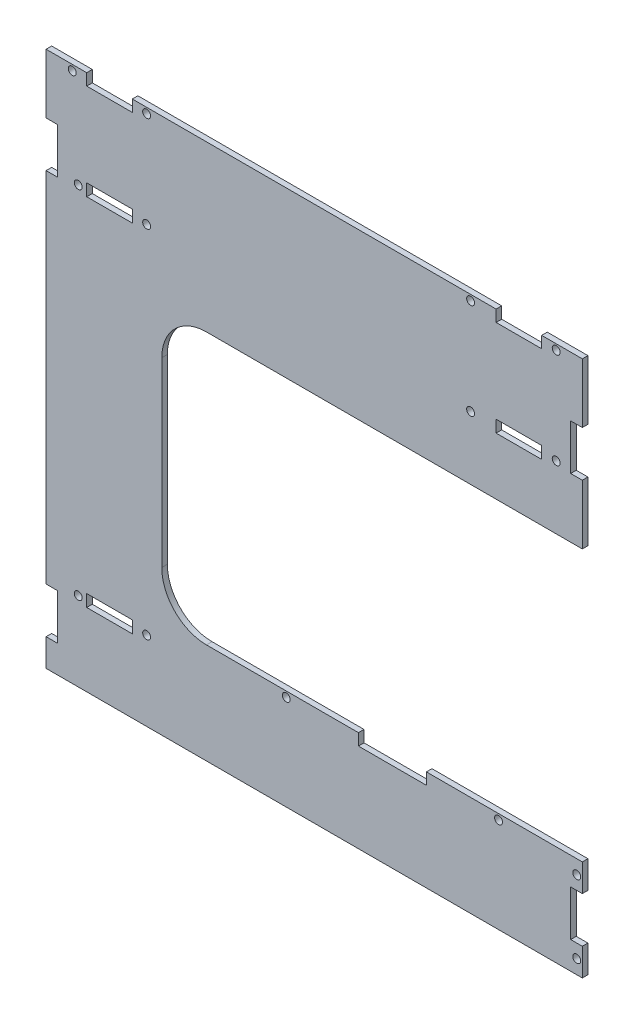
ISO-10303-21;
HEADER;
FILE_DESCRIPTION(('STEP AP214'),'2;1');
FILE_NAME('part.step','',(''),(''),'','','');
FILE_SCHEMA(('AUTOMOTIVE_DESIGN { 1 0 10303 214 1 1 1 1 }'));
ENDSEC;
DATA;
#1=APPLICATION_CONTEXT('core data for automotive mechanical design processes');
#2=APPLICATION_PROTOCOL_DEFINITION('international standard','automotive_design',2000,#1);
#3=PRODUCT_CONTEXT('',#1,'mechanical');
#4=PRODUCT('Part','Part','',(#3));
#5=PRODUCT_RELATED_PRODUCT_CATEGORY('part','',(#4));
#6=PRODUCT_DEFINITION_FORMATION('','',#4);
#7=PRODUCT_DEFINITION_CONTEXT('part definition',#1,'design');
#8=PRODUCT_DEFINITION('design','',#6,#7);
#9=PRODUCT_DEFINITION_SHAPE('','',#8);
#10=(LENGTH_UNIT() NAMED_UNIT(*) SI_UNIT(.MILLI.,.METRE.));
#11=(NAMED_UNIT(*) PLANE_ANGLE_UNIT() SI_UNIT($,.RADIAN.));
#12=(NAMED_UNIT(*) SI_UNIT($,.STERADIAN.) SOLID_ANGLE_UNIT());
#13=UNCERTAINTY_MEASURE_WITH_UNIT(LENGTH_MEASURE(1.E-05),#10,'distance_accuracy_value','');
#14=(GEOMETRIC_REPRESENTATION_CONTEXT(3) GLOBAL_UNCERTAINTY_ASSIGNED_CONTEXT((#13)) GLOBAL_UNIT_ASSIGNED_CONTEXT((#10,
#11,#12)) REPRESENTATION_CONTEXT('',''));
#15=CARTESIAN_POINT('',(0.,0.,0.));
#16=DIRECTION('',(0.,0.,1.));
#17=DIRECTION('',(1.,0.,0.));
#18=AXIS2_PLACEMENT_3D('',#15,#16,#17);
#19=CARTESIAN_POINT('',(91.15,82.5500000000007,-304.8));
#20=DIRECTION('',(0.,0.,1.));
#21=DIRECTION('',(0.,-1.,0.));
#22=AXIS2_PLACEMENT_3D('',#19,#20,#21);
#23=PLANE('',#22);
#24=CARTESIAN_POINT('',(289.95,247.150800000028,-304.800000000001));
#25=DIRECTION('',(0.,0.,-1.));
#26=DIRECTION('',(0.,1.,0.));
#27=AXIS2_PLACEMENT_3D('',#24,#25,#26);
#28=CIRCLE('',#27,2.24999999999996);
#29=CARTESIAN_POINT('',(289.95,249.400800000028,-304.800000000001));
#30=VERTEX_POINT('',#29);
#31=EDGE_CURVE('E386',#30,#30,#28,.T.);
#32=ORIENTED_EDGE('',*,*,#31,.F.);
#33=EDGE_LOOP('',(#32));
#34=FACE_BOUND('',#33,.T.);
#35=CARTESIAN_POINT('',(241.3,301.625,-304.800000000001));
#36=DIRECTION('',(0.,0.,-1.));
#37=DIRECTION('',(0.,1.,0.));
#38=AXIS2_PLACEMENT_3D('',#35,#36,#37);
#39=CIRCLE('',#38,2.25000000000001);
#40=CARTESIAN_POINT('',(241.3,303.875,-304.800000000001));
#41=VERTEX_POINT('',#40);
#42=EDGE_CURVE('E426',#41,#41,#39,.T.);
#43=ORIENTED_EDGE('',*,*,#42,.F.);
#44=EDGE_LOOP('',(#43));
#45=FACE_BOUND('',#44,.T.);
#46=CARTESIAN_POINT('',(289.95,301.625,-304.800000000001));
#47=DIRECTION('',(0.,0.,-1.));
#48=DIRECTION('',(0.,1.,0.));
#49=AXIS2_PLACEMENT_3D('',#46,#47,#48);
#50=CIRCLE('',#49,2.24999999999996);
#51=CARTESIAN_POINT('',(289.95,303.875,-304.800000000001));
#52=VERTEX_POINT('',#51);
#53=EDGE_CURVE('E415',#52,#52,#50,.T.);
#54=ORIENTED_EDGE('',*,*,#53,.F.);
#55=EDGE_LOOP('',(#54));
#56=FACE_BOUND('',#55,.T.);
#57=DIRECTION('',(-1.,0.,0.));
#58=VECTOR('',#57,1.);
#59=CARTESIAN_POINT('',(49.004,243.721800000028,-304.800000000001));
#60=LINE('',#59,#58);
#61=CARTESIAN_POINT('',(49.004,243.721800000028,-304.800000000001));
#62=VERTEX_POINT('',#61);
#63=CARTESIAN_POINT('',(23.096,243.721800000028,-304.800000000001));
#64=VERTEX_POINT('',#63);
#65=EDGE_CURVE('E395',#62,#64,#60,.T.);
#66=ORIENTED_EDGE('',*,*,#65,.F.);
#67=DIRECTION('',(0.,-1.,0.));
#68=VECTOR('',#67,1.);
#69=CARTESIAN_POINT('',(49.004,250.579800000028,-304.800000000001));
#70=LINE('',#69,#68);
#71=CARTESIAN_POINT('',(49.004,250.579800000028,-304.800000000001));
#72=VERTEX_POINT('',#71);
#73=EDGE_CURVE('E56',#72,#62,#70,.T.);
#74=ORIENTED_EDGE('',*,*,#73,.F.);
#75=DIRECTION('',(1.,0.,0.));
#76=VECTOR('',#75,1.);
#77=CARTESIAN_POINT('',(23.096,250.579800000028,-304.800000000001));
#78=LINE('',#77,#76);
#79=CARTESIAN_POINT('',(23.096,250.579800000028,-304.800000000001));
#80=VERTEX_POINT('',#79);
#81=EDGE_CURVE('E379',#80,#72,#78,.T.);
#82=ORIENTED_EDGE('',*,*,#81,.F.);
#83=DIRECTION('',(0.,1.,0.));
#84=VECTOR('',#83,1.);
#85=CARTESIAN_POINT('',(23.096,243.721800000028,-304.800000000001));
#86=LINE('',#85,#84);
#87=EDGE_CURVE('E383',#64,#80,#86,.T.);
#88=ORIENTED_EDGE('',*,*,#87,.F.);
#89=EDGE_LOOP('',(#66,#74,#82,#88));
#90=FACE_BOUND('',#89,.T.);
#91=CARTESIAN_POINT('',(57.15,247.150800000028,-304.800000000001));
#92=DIRECTION('',(0.,0.,-1.));
#93=DIRECTION('',(0.,1.,0.));
#94=AXIS2_PLACEMENT_3D('',#91,#92,#93);
#95=CIRCLE('',#94,2.25);
#96=CARTESIAN_POINT('',(57.15,249.400800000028,-304.800000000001));
#97=VERTEX_POINT('',#96);
#98=EDGE_CURVE('E451',#97,#97,#95,.T.);
#99=ORIENTED_EDGE('',*,*,#98,.F.);
#100=EDGE_LOOP('',(#99));
#101=FACE_BOUND('',#100,.T.);
#102=CARTESIAN_POINT('',(14.85,301.625,-304.800000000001));
#103=DIRECTION('',(0.,0.,-1.));
#104=DIRECTION('',(0.,1.,0.));
#105=AXIS2_PLACEMENT_3D('',#102,#103,#104);
#106=CIRCLE('',#105,2.25);
#107=CARTESIAN_POINT('',(14.85,303.875,-304.800000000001));
#108=VERTEX_POINT('',#107);
#109=EDGE_CURVE('E1201',#108,#108,#106,.T.);
#110=ORIENTED_EDGE('',*,*,#109,.F.);
#111=EDGE_LOOP('',(#110));
#112=FACE_BOUND('',#111,.T.);
#113=CARTESIAN_POINT('',(57.15,301.625,-304.800000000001));
#114=DIRECTION('',(0.,0.,-1.));
#115=DIRECTION('',(0.,1.,0.));
#116=AXIS2_PLACEMENT_3D('',#113,#114,#115);
#117=CIRCLE('',#116,2.25);
#118=CARTESIAN_POINT('',(57.15,303.875,-304.800000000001));
#119=VERTEX_POINT('',#118);
#120=EDGE_CURVE('E1198',#119,#119,#117,.T.);
#121=ORIENTED_EDGE('',*,*,#120,.F.);
#122=EDGE_LOOP('',(#121));
#123=FACE_BOUND('',#122,.T.);
#124=CARTESIAN_POINT('',(241.3,247.150800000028,-304.800000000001));
#125=DIRECTION('',(0.,0.,-1.));
#126=DIRECTION('',(0.,1.,0.));
#127=AXIS2_PLACEMENT_3D('',#124,#125,#126);
#128=CIRCLE('',#127,2.25000000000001);
#129=CARTESIAN_POINT('',(241.3,249.400800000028,-304.800000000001));
#130=VERTEX_POINT('',#129);
#131=EDGE_CURVE('E442',#130,#130,#128,.T.);
#132=ORIENTED_EDGE('',*,*,#131,.F.);
#133=EDGE_LOOP('',(#132));
#134=FACE_BOUND('',#133,.T.);
#135=DIRECTION('',(1.,0.,0.));
#136=VECTOR('',#135,1.);
#137=CARTESIAN_POINT('',(255.796,250.579800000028,-304.800000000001));
#138=LINE('',#137,#136);
#139=CARTESIAN_POINT('',(255.796,250.579800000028,-304.800000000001));
#140=VERTEX_POINT('',#139);
#141=CARTESIAN_POINT('',(281.704,250.579800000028,-304.800000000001));
#142=VERTEX_POINT('',#141);
#143=EDGE_CURVE('E464',#140,#142,#138,.T.);
#144=ORIENTED_EDGE('',*,*,#143,.F.);
#145=DIRECTION('',(0.,1.,0.));
#146=VECTOR('',#145,1.);
#147=CARTESIAN_POINT('',(255.796,243.721800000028,-304.800000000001));
#148=LINE('',#147,#146);
#149=CARTESIAN_POINT('',(255.796,243.721800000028,-304.800000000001));
#150=VERTEX_POINT('',#149);
#151=EDGE_CURVE('E64',#150,#140,#148,.T.);
#152=ORIENTED_EDGE('',*,*,#151,.F.);
#153=DIRECTION('',(-1.,0.,0.));
#154=VECTOR('',#153,1.);
#155=CARTESIAN_POINT('',(281.704,243.721800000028,-304.800000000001));
#156=LINE('',#155,#154);
#157=CARTESIAN_POINT('',(281.704,243.721800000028,-304.800000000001));
#158=VERTEX_POINT('',#157);
#159=EDGE_CURVE('E476',#158,#150,#156,.T.);
#160=ORIENTED_EDGE('',*,*,#159,.F.);
#161=DIRECTION('',(0.,-1.,0.));
#162=VECTOR('',#161,1.);
#163=CARTESIAN_POINT('',(281.704,250.579800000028,-304.800000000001));
#164=LINE('',#163,#162);
#165=EDGE_CURVE('E469',#142,#158,#164,.T.);
#166=ORIENTED_EDGE('',*,*,#165,.F.);
#167=EDGE_LOOP('',(#144,#152,#160,#166));
#168=FACE_BOUND('',#167,.T.);
#169=DIRECTION('',(-1.,0.,0.));
#170=VECTOR('',#169,1.);
#171=CARTESIAN_POINT('',(49.004,41.5361999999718,-304.8));
#172=LINE('',#171,#170);
#173=CARTESIAN_POINT('',(49.004,41.5361999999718,-304.8));
#174=VERTEX_POINT('',#173);
#175=CARTESIAN_POINT('',(23.096,41.5361999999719,-304.8));
#176=VERTEX_POINT('',#175);
#177=EDGE_CURVE('E485',#174,#176,#172,.T.);
#178=ORIENTED_EDGE('',*,*,#177,.F.);
#179=DIRECTION('',(0.,-1.,0.));
#180=VECTOR('',#179,1.);
#181=CARTESIAN_POINT('',(49.004,48.3941999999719,-304.8));
#182=LINE('',#181,#180);
#183=CARTESIAN_POINT('',(49.004,48.3941999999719,-304.8));
#184=VERTEX_POINT('',#183);
#185=EDGE_CURVE('E491',#184,#174,#182,.T.);
#186=ORIENTED_EDGE('',*,*,#185,.F.);
#187=DIRECTION('',(1.,0.,0.));
#188=VECTOR('',#187,1.);
#189=CARTESIAN_POINT('',(23.096,48.3941999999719,-304.8));
#190=LINE('',#189,#188);
#191=CARTESIAN_POINT('',(23.096,48.3941999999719,-304.8));
#192=VERTEX_POINT('',#191);
#193=EDGE_CURVE('E498',#192,#184,#190,.T.);
#194=ORIENTED_EDGE('',*,*,#193,.F.);
#195=DIRECTION('',(0.,1.,0.));
#196=VECTOR('',#195,1.);
#197=CARTESIAN_POINT('',(23.096,41.5361999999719,-304.8));
#198=LINE('',#197,#196);
#199=EDGE_CURVE('E490',#176,#192,#198,.T.);
#200=ORIENTED_EDGE('',*,*,#199,.F.);
#201=EDGE_LOOP('',(#178,#186,#194,#200));
#202=FACE_BOUND('',#201,.T.);
#203=CARTESIAN_POINT('',(136.525,53.975,-304.8));
#204=DIRECTION('',(0.,0.,-1.));
#205=DIRECTION('',(0.,1.,0.));
#206=AXIS2_PLACEMENT_3D('',#203,#204,#205);
#207=CIRCLE('',#206,2.25000000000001);
#208=CARTESIAN_POINT('',(136.525,56.225,-304.8));
#209=VERTEX_POINT('',#208);
#210=EDGE_CURVE('E507',#209,#209,#207,.T.);
#211=ORIENTED_EDGE('',*,*,#210,.F.);
#212=EDGE_LOOP('',(#211));
#213=FACE_BOUND('',#212,.T.);
#214=CARTESIAN_POINT('',(18.27,44.9651999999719,-304.8));
#215=DIRECTION('',(0.,0.,-1.));
#216=DIRECTION('',(0.,1.,0.));
#217=AXIS2_PLACEMENT_3D('',#214,#215,#216);
#218=CIRCLE('',#217,2.25);
#219=CARTESIAN_POINT('',(18.27,47.2151999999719,-304.8));
#220=VERTEX_POINT('',#219);
#221=EDGE_CURVE('E1571',#220,#220,#218,.T.);
#222=ORIENTED_EDGE('',*,*,#221,.F.);
#223=EDGE_LOOP('',(#222));
#224=FACE_BOUND('',#223,.T.);
#225=CARTESIAN_POINT('',(57.15,44.9651999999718,-304.8));
#226=DIRECTION('',(0.,0.,-1.));
#227=DIRECTION('',(0.,1.,0.));
#228=AXIS2_PLACEMENT_3D('',#225,#226,#227);
#229=CIRCLE('',#228,2.25);
#230=CARTESIAN_POINT('',(57.15,47.2151999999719,-304.8));
#231=VERTEX_POINT('',#230);
#232=EDGE_CURVE('E1575',#231,#231,#229,.T.);
#233=ORIENTED_EDGE('',*,*,#232,.F.);
#234=EDGE_LOOP('',(#233));
#235=FACE_BOUND('',#234,.T.);
#236=CARTESIAN_POINT('',(18.27,247.150800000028,-304.800000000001));
#237=DIRECTION('',(0.,0.,-1.));
#238=DIRECTION('',(0.,1.,0.));
#239=AXIS2_PLACEMENT_3D('',#236,#237,#238);
#240=CIRCLE('',#239,2.25);
#241=CARTESIAN_POINT('',(18.27,249.400800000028,-304.800000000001));
#242=VERTEX_POINT('',#241);
#243=EDGE_CURVE('E518',#242,#242,#240,.T.);
#244=ORIENTED_EDGE('',*,*,#243,.F.);
#245=EDGE_LOOP('',(#244));
#246=FACE_BOUND('',#245,.T.);
#247=CARTESIAN_POINT('',(257.175,53.975,-304.8));
#248=DIRECTION('',(0.,0.,-1.));
#249=DIRECTION('',(0.,1.,0.));
#250=AXIS2_PLACEMENT_3D('',#247,#248,#249);
#251=CIRCLE('',#250,2.24999999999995);
#252=CARTESIAN_POINT('',(257.175,56.225,-304.8));
#253=VERTEX_POINT('',#252);
#254=EDGE_CURVE('E531',#253,#253,#251,.T.);
#255=ORIENTED_EDGE('',*,*,#254,.F.);
#256=EDGE_LOOP('',(#255));
#257=FACE_BOUND('',#256,.T.);
#258=CARTESIAN_POINT('',(301.625,49.2125000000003,-304.8));
#259=DIRECTION('',(0.,0.,-1.));
#260=DIRECTION('',(0.,1.,0.));
#261=AXIS2_PLACEMENT_3D('',#258,#259,#260);
#262=CIRCLE('',#261,2.24999999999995);
#263=CARTESIAN_POINT('',(301.625,51.4625000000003,-304.8));
#264=VERTEX_POINT('',#263);
#265=EDGE_CURVE('E539',#264,#264,#262,.T.);
#266=ORIENTED_EDGE('',*,*,#265,.F.);
#267=EDGE_LOOP('',(#266));
#268=FACE_BOUND('',#267,.T.);
#269=CARTESIAN_POINT('',(301.625,7.93750000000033,-304.8));
#270=DIRECTION('',(0.,0.,-1.));
#271=DIRECTION('',(0.,1.,0.));
#272=AXIS2_PLACEMENT_3D('',#269,#270,#271);
#273=CIRCLE('',#272,2.24999999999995);
#274=CARTESIAN_POINT('',(301.625,10.1875000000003,-304.8));
#275=VERTEX_POINT('',#274);
#276=EDGE_CURVE('E547',#275,#275,#273,.T.);
#277=ORIENTED_EDGE('',*,*,#276,.F.);
#278=EDGE_LOOP('',(#277));
#279=FACE_BOUND('',#278,.T.);
#280=DIRECTION('',(0.,1.,0.));
#281=VECTOR('',#280,1.);
#282=CARTESIAN_POINT('',(0.,6.59194920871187E-13,-304.8));
#283=LINE('',#282,#281);
#284=CARTESIAN_POINT('',(0.,6.59194920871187E-13,-304.8));
#285=VERTEX_POINT('',#284);
#286=CARTESIAN_POINT('',(0.,15.621,-304.8));
#287=VERTEX_POINT('',#286);
#288=EDGE_CURVE('E559',#285,#287,#283,.T.);
#289=ORIENTED_EDGE('',*,*,#288,.T.);
#290=DIRECTION('',(-1.,0.,0.));
#291=VECTOR('',#290,1.);
#292=CARTESIAN_POINT('',(0.254,15.621,-304.8));
#293=LINE('',#292,#291);
#294=CARTESIAN_POINT('',(6.604,15.621,-304.8));
#295=VERTEX_POINT('',#294);
#296=EDGE_CURVE('E915',#295,#287,#293,.T.);
#297=ORIENTED_EDGE('',*,*,#296,.F.);
#298=DIRECTION('',(0.,-1.,0.));
#299=VECTOR('',#298,1.);
#300=CARTESIAN_POINT('',(6.604,15.621,-304.8));
#301=LINE('',#300,#299);
#302=CARTESIAN_POINT('',(6.604,41.529,-304.8));
#303=VERTEX_POINT('',#302);
#304=EDGE_CURVE('E924',#303,#295,#301,.T.);
#305=ORIENTED_EDGE('',*,*,#304,.F.);
#306=DIRECTION('',(1.,0.,0.));
#307=VECTOR('',#306,1.);
#308=CARTESIAN_POINT('',(6.604,41.529,-304.8));
#309=LINE('',#308,#307);
#310=CARTESIAN_POINT('',(0.,41.529,-304.8));
#311=VERTEX_POINT('',#310);
#312=EDGE_CURVE('E594',#311,#303,#309,.T.);
#313=ORIENTED_EDGE('',*,*,#312,.F.);
#314=DIRECTION('',(0.,1.,0.));
#315=VECTOR('',#314,1.);
#316=CARTESIAN_POINT('',(0.,41.2750000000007,-304.8));
#317=LINE('',#316,#315);
#318=CARTESIAN_POINT('',(0.,245.046000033,-304.800000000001));
#319=VERTEX_POINT('',#318);
#320=EDGE_CURVE('E564',#311,#319,#317,.T.);
#321=ORIENTED_EDGE('',*,*,#320,.T.);
#322=DIRECTION('',(-1.,0.,0.));
#323=VECTOR('',#322,1.);
#324=CARTESIAN_POINT('',(0.,245.046000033,-304.800000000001));
#325=LINE('',#324,#323);
#326=CARTESIAN_POINT('',(6.60400000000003,245.046000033,-304.800000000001));
#327=VERTEX_POINT('',#326);
#328=EDGE_CURVE('E583',#327,#319,#325,.T.);
#329=ORIENTED_EDGE('',*,*,#328,.F.);
#330=DIRECTION('',(0.,-1.,0.));
#331=VECTOR('',#330,1.);
#332=CARTESIAN_POINT('',(6.60400000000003,245.046000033,-304.800000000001));
#333=LINE('',#332,#331);
#334=CARTESIAN_POINT('',(6.60400000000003,270.954000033,-304.800000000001));
#335=VERTEX_POINT('',#334);
#336=EDGE_CURVE('E588',#335,#327,#333,.T.);
#337=ORIENTED_EDGE('',*,*,#336,.F.);
#338=DIRECTION('',(1.,0.,0.));
#339=VECTOR('',#338,1.);
#340=CARTESIAN_POINT('',(6.60400000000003,270.954000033,-304.800000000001));
#341=LINE('',#340,#339);
#342=CARTESIAN_POINT('',(0.,270.954000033,-304.800000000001));
#343=VERTEX_POINT('',#342);
#344=EDGE_CURVE('E944',#343,#335,#341,.T.);
#345=ORIENTED_EDGE('',*,*,#344,.F.);
#346=DIRECTION('',(0.,1.,0.));
#347=VECTOR('',#346,1.);
#348=CARTESIAN_POINT('',(0.,270.700000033,-304.800000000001));
#349=LINE('',#348,#347);
#350=CARTESIAN_POINT('',(0.,304.800000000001,-304.800000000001));
#351=VERTEX_POINT('',#350);
#352=EDGE_CURVE('E572',#343,#351,#349,.T.);
#353=ORIENTED_EDGE('',*,*,#352,.T.);
#354=DIRECTION('',(1.,0.,0.));
#355=VECTOR('',#354,1.);
#356=CARTESIAN_POINT('',(23.35,304.800000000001,-304.800000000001));
#357=LINE('',#356,#355);
#358=CARTESIAN_POINT('',(23.096,304.800000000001,-304.800000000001));
#359=VERTEX_POINT('',#358);
#360=EDGE_CURVE('E636',#351,#359,#357,.T.);
#361=ORIENTED_EDGE('',*,*,#360,.T.);
#362=DIRECTION('',(0.,1.,0.));
#363=VECTOR('',#362,1.);
#364=CARTESIAN_POINT('',(23.096,304.800000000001,-304.800000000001));
#365=LINE('',#364,#363);
#366=CARTESIAN_POINT('',(23.096,298.196,-304.800000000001));
#367=VERTEX_POINT('',#366);
#368=EDGE_CURVE('E606',#367,#359,#365,.T.);
#369=ORIENTED_EDGE('',*,*,#368,.F.);
#370=DIRECTION('',(-1.,0.,0.));
#371=VECTOR('',#370,1.);
#372=CARTESIAN_POINT('',(23.096,298.196,-304.800000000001));
#373=LINE('',#372,#371);
#374=CARTESIAN_POINT('',(49.004,298.196,-304.800000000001));
#375=VERTEX_POINT('',#374);
#376=EDGE_CURVE('E618',#375,#367,#373,.T.);
#377=ORIENTED_EDGE('',*,*,#376,.F.);
#378=DIRECTION('',(0.,-1.,0.));
#379=VECTOR('',#378,1.);
#380=CARTESIAN_POINT('',(49.004,298.196,-304.800000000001));
#381=LINE('',#380,#379);
#382=CARTESIAN_POINT('',(49.004,304.8,-304.800000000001));
#383=VERTEX_POINT('',#382);
#384=EDGE_CURVE('E613',#383,#375,#381,.T.);
#385=ORIENTED_EDGE('',*,*,#384,.F.);
#386=DIRECTION('',(1.,0.,0.));
#387=VECTOR('',#386,1.);
#388=CARTESIAN_POINT('',(256.05,304.8,-304.800000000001));
#389=LINE('',#388,#387);
#390=CARTESIAN_POINT('',(255.796,304.8,-304.800000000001));
#391=VERTEX_POINT('',#390);
#392=EDGE_CURVE('E630',#383,#391,#389,.T.);
#393=ORIENTED_EDGE('',*,*,#392,.T.);
#394=DIRECTION('',(0.,1.,0.));
#395=VECTOR('',#394,1.);
#396=CARTESIAN_POINT('',(255.796,304.8,-304.800000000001));
#397=LINE('',#396,#395);
#398=CARTESIAN_POINT('',(255.796,298.196,-304.800000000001));
#399=VERTEX_POINT('',#398);
#400=EDGE_CURVE('E965',#399,#391,#397,.T.);
#401=ORIENTED_EDGE('',*,*,#400,.F.);
#402=DIRECTION('',(-1.,0.,0.));
#403=VECTOR('',#402,1.);
#404=CARTESIAN_POINT('',(255.796,298.196,-304.800000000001));
#405=LINE('',#404,#403);
#406=CARTESIAN_POINT('',(281.704,298.196,-304.800000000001));
#407=VERTEX_POINT('',#406);
#408=EDGE_CURVE('E975',#407,#399,#405,.T.);
#409=ORIENTED_EDGE('',*,*,#408,.F.);
#410=DIRECTION('',(0.,-1.,0.));
#411=VECTOR('',#410,1.);
#412=CARTESIAN_POINT('',(281.704,298.196,-304.800000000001));
#413=LINE('',#412,#411);
#414=CARTESIAN_POINT('',(281.704,304.800000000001,-304.800000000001));
#415=VERTEX_POINT('',#414);
#416=EDGE_CURVE('E664',#415,#407,#413,.T.);
#417=ORIENTED_EDGE('',*,*,#416,.F.);
#418=DIRECTION('',(1.,0.,0.));
#419=VECTOR('',#418,1.);
#420=CARTESIAN_POINT('',(304.8,304.800000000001,-304.800000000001));
#421=LINE('',#420,#419);
#422=CARTESIAN_POINT('',(304.8,304.800000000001,-304.800000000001));
#423=VERTEX_POINT('',#422);
#424=EDGE_CURVE('E635',#415,#423,#421,.T.);
#425=ORIENTED_EDGE('',*,*,#424,.T.);
#426=DIRECTION('',(0.,-1.,0.));
#427=VECTOR('',#426,1.);
#428=CARTESIAN_POINT('',(304.8,270.700000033,-304.800000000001));
#429=LINE('',#428,#427);
#430=CARTESIAN_POINT('',(304.8,270.954000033,-304.800000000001));
#431=VERTEX_POINT('',#430);
#432=EDGE_CURVE('E641',#423,#431,#429,.T.);
#433=ORIENTED_EDGE('',*,*,#432,.T.);
#434=DIRECTION('',(1.,0.,0.));
#435=VECTOR('',#434,1.);
#436=CARTESIAN_POINT('',(304.8,270.954000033,-304.800000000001));
#437=LINE('',#436,#435);
#438=CARTESIAN_POINT('',(298.196,270.954000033,-304.800000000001));
#439=VERTEX_POINT('',#438);
#440=EDGE_CURVE('E653',#439,#431,#437,.T.);
#441=ORIENTED_EDGE('',*,*,#440,.F.);
#442=DIRECTION('',(0.,1.,0.));
#443=VECTOR('',#442,1.);
#444=CARTESIAN_POINT('',(298.196,270.954000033,-304.800000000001));
#445=LINE('',#444,#443);
#446=CARTESIAN_POINT('',(298.196,245.046000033,-304.800000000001));
#447=VERTEX_POINT('',#446);
#448=EDGE_CURVE('E658',#447,#439,#445,.T.);
#449=ORIENTED_EDGE('',*,*,#448,.F.);
#450=DIRECTION('',(-1.,0.,0.));
#451=VECTOR('',#450,1.);
#452=CARTESIAN_POINT('',(298.196,245.046000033,-304.800000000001));
#453=LINE('',#452,#451);
#454=CARTESIAN_POINT('',(304.8,245.046000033,-304.800000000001));
#455=VERTEX_POINT('',#454);
#456=EDGE_CURVE('E866',#455,#447,#453,.T.);
#457=ORIENTED_EDGE('',*,*,#456,.F.);
#458=DIRECTION('',(0.,-1.,0.));
#459=VECTOR('',#458,1.);
#460=CARTESIAN_POINT('',(304.8,211.200000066,-304.800000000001));
#461=LINE('',#460,#459);
#462=CARTESIAN_POINT('',(304.8,211.200000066,-304.800000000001));
#463=VERTEX_POINT('',#462);
#464=EDGE_CURVE('E860',#455,#463,#461,.T.);
#465=ORIENTED_EDGE('',*,*,#464,.T.);
#466=DIRECTION('',(-1.,0.,0.));
#467=VECTOR('',#466,1.);
#468=CARTESIAN_POINT('',(304.8,211.200000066,-304.800000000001));
#469=LINE('',#468,#467);
#470=CARTESIAN_POINT('',(91.15,211.200000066,-304.800000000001));
#471=VERTEX_POINT('',#470);
#472=EDGE_CURVE('E852',#463,#471,#469,.T.);
#473=ORIENTED_EDGE('',*,*,#472,.T.);
#474=CARTESIAN_POINT('',(91.15,185.800000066,-304.8));
#475=DIRECTION('',(0.,0.,1.));
#476=DIRECTION('',(0.,-1.,0.));
#477=AXIS2_PLACEMENT_3D('',#474,#475,#476);
#478=CIRCLE('',#477,25.4);
#479=CARTESIAN_POINT('',(65.75,185.800000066,-304.8));
#480=VERTEX_POINT('',#479);
#481=EDGE_CURVE('E846',#471,#480,#478,.T.);
#482=ORIENTED_EDGE('',*,*,#481,.T.);
#483=DIRECTION('',(0.,-1.,0.));
#484=VECTOR('',#483,1.);
#485=CARTESIAN_POINT('',(65.75,185.800000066,-304.8));
#486=LINE('',#485,#484);
#487=CARTESIAN_POINT('',(65.75,82.5500000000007,-304.8));
#488=VERTEX_POINT('',#487);
#489=EDGE_CURVE('E839',#480,#488,#486,.T.);
#490=ORIENTED_EDGE('',*,*,#489,.T.);
#491=CARTESIAN_POINT('',(91.15,82.5500000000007,-304.8));
#492=DIRECTION('',(0.,0.,1.));
#493=DIRECTION('',(0.,-1.,0.));
#494=AXIS2_PLACEMENT_3D('',#491,#492,#493);
#495=CIRCLE('',#494,25.4);
#496=CARTESIAN_POINT('',(91.15,57.1500000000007,-304.8));
#497=VERTEX_POINT('',#496);
#498=EDGE_CURVE('E834',#488,#497,#495,.T.);
#499=ORIENTED_EDGE('',*,*,#498,.T.);
#500=DIRECTION('',(1.,0.,0.));
#501=VECTOR('',#500,1.);
#502=CARTESIAN_POINT('',(177.8,57.15,-304.8));
#503=LINE('',#502,#501);
#504=CARTESIAN_POINT('',(177.546,57.15,-304.8));
#505=VERTEX_POINT('',#504);
#506=EDGE_CURVE('E705',#497,#505,#503,.T.);
#507=ORIENTED_EDGE('',*,*,#506,.T.);
#508=DIRECTION('',(0.,1.,0.));
#509=VECTOR('',#508,1.);
#510=CARTESIAN_POINT('',(177.546,57.15,-304.8));
#511=LINE('',#510,#509);
#512=CARTESIAN_POINT('',(177.546,50.546,-304.8));
#513=VERTEX_POINT('',#512);
#514=EDGE_CURVE('E676',#513,#505,#511,.T.);
#515=ORIENTED_EDGE('',*,*,#514,.F.);
#516=DIRECTION('',(-1.,0.,0.));
#517=VECTOR('',#516,1.);
#518=CARTESIAN_POINT('',(177.546,50.546,-304.8));
#519=LINE('',#518,#517);
#520=CARTESIAN_POINT('',(216.154,50.546,-304.8));
#521=VERTEX_POINT('',#520);
#522=EDGE_CURVE('E688',#521,#513,#519,.T.);
#523=ORIENTED_EDGE('',*,*,#522,.F.);
#524=DIRECTION('',(0.,-1.,0.));
#525=VECTOR('',#524,1.);
#526=CARTESIAN_POINT('',(216.154,50.546,-304.8));
#527=LINE('',#526,#525);
#528=CARTESIAN_POINT('',(216.154,57.15,-304.8));
#529=VERTEX_POINT('',#528);
#530=EDGE_CURVE('E683',#529,#521,#527,.T.);
#531=ORIENTED_EDGE('',*,*,#530,.F.);
#532=DIRECTION('',(1.,0.,0.));
#533=VECTOR('',#532,1.);
#534=CARTESIAN_POINT('',(304.8,57.1500000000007,-304.8));
#535=LINE('',#534,#533);
#536=CARTESIAN_POINT('',(304.8,57.1500000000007,-304.8));
#537=VERTEX_POINT('',#536);
#538=EDGE_CURVE('E700',#529,#537,#535,.T.);
#539=ORIENTED_EDGE('',*,*,#538,.T.);
#540=DIRECTION('',(0.,-1.,0.));
#541=VECTOR('',#540,1.);
#542=CARTESIAN_POINT('',(304.8,41.275,-304.8));
#543=LINE('',#542,#541);
#544=CARTESIAN_POINT('',(304.8,41.529,-304.8));
#545=VERTEX_POINT('',#544);
#546=EDGE_CURVE('E704',#537,#545,#543,.T.);
#547=ORIENTED_EDGE('',*,*,#546,.T.);
#548=DIRECTION('',(1.,0.,0.));
#549=VECTOR('',#548,1.);
#550=CARTESIAN_POINT('',(304.8,41.529,-304.8));
#551=LINE('',#550,#549);
#552=CARTESIAN_POINT('',(298.196,41.529,-304.8));
#553=VERTEX_POINT('',#552);
#554=EDGE_CURVE('E769',#553,#545,#551,.T.);
#555=ORIENTED_EDGE('',*,*,#554,.F.);
#556=DIRECTION('',(0.,1.,0.));
#557=VECTOR('',#556,1.);
#558=CARTESIAN_POINT('',(298.196,41.529,-304.8));
#559=LINE('',#558,#557);
#560=CARTESIAN_POINT('',(298.196,15.621,-304.8));
#561=VERTEX_POINT('',#560);
#562=EDGE_CURVE('E761',#561,#553,#559,.T.);
#563=ORIENTED_EDGE('',*,*,#562,.F.);
#564=DIRECTION('',(-1.,0.,0.));
#565=VECTOR('',#564,1.);
#566=CARTESIAN_POINT('',(298.196,15.621,-304.8));
#567=LINE('',#566,#565);
#568=CARTESIAN_POINT('',(304.8,15.621,-304.8));
#569=VERTEX_POINT('',#568);
#570=EDGE_CURVE('E756',#569,#561,#567,.T.);
#571=ORIENTED_EDGE('',*,*,#570,.F.);
#572=DIRECTION('',(0.,-1.,0.));
#573=VECTOR('',#572,1.);
#574=CARTESIAN_POINT('',(304.8,6.59389333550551E-13,-304.8));
#575=LINE('',#574,#573);
#576=CARTESIAN_POINT('',(304.8,6.59389333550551E-13,-304.8));
#577=VERTEX_POINT('',#576);
#578=EDGE_CURVE('E748',#569,#577,#575,.T.);
#579=ORIENTED_EDGE('',*,*,#578,.T.);
#580=DIRECTION('',(-1.,0.,0.));
#581=VECTOR('',#580,1.);
#582=CARTESIAN_POINT('',(304.8,6.59389333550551E-13,-304.8));
#583=LINE('',#582,#581);
#584=EDGE_CURVE('E565',#577,#285,#583,.T.);
#585=ORIENTED_EDGE('',*,*,#584,.T.);
#586=EDGE_LOOP('',(#289,#297,#305,#313,#321,#329,#337,#345,#353,#361,#369,#377,#385,#393,#401,
#409,#417,#425,#433,#441,#449,#457,#465,#473,#482,#490,#499,#507,#515,#523,#531,#539,#547,#555,
#563,#571,#579,#585));
#587=FACE_BOUND('',#586,.T.);
#588=ADVANCED_FACE('F39',(#34,#45,#56,#90,#101,#112,#123,#134,#168,#202,#213,#224,#235,#246,
#257,#268,#279,#587),#23,.F.);
#589=CARTESIAN_POINT('',(304.8,41.275,-301.625));
#590=DIRECTION('',(1.,0.,0.));
#591=DIRECTION('',(0.,0.,-1.));
#592=AXIS2_PLACEMENT_3D('',#589,#590,#591);
#593=PLANE('',#592);
#594=DIRECTION('',(0.,0.,-1.));
#595=VECTOR('',#594,1.);
#596=CARTESIAN_POINT('',(304.8,41.529,-301.625));
#597=LINE('',#596,#595);
#598=CARTESIAN_POINT('',(304.8,41.529,-301.625));
#599=VERTEX_POINT('',#598);
#600=EDGE_CURVE('E751',#599,#545,#597,.T.);
#601=ORIENTED_EDGE('',*,*,#600,.T.);
#602=ORIENTED_EDGE('',*,*,#546,.F.);
#603=DIRECTION('',(0.,0.,-1.));
#604=VECTOR('',#603,1.);
#605=CARTESIAN_POINT('',(304.8,57.1500000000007,-301.625));
#606=LINE('',#605,#604);
#607=CARTESIAN_POINT('',(304.8,57.1500000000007,-301.625));
#608=VERTEX_POINT('',#607);
#609=EDGE_CURVE('E12',#608,#537,#606,.T.);
#610=ORIENTED_EDGE('',*,*,#609,.F.);
#611=DIRECTION('',(0.,-1.,0.));
#612=VECTOR('',#611,1.);
#613=CARTESIAN_POINT('',(304.8,41.275,-301.625));
#614=LINE('',#613,#612);
#615=EDGE_CURVE('E734',#608,#599,#614,.T.);
#616=ORIENTED_EDGE('',*,*,#615,.T.);
#617=EDGE_LOOP('',(#601,#602,#610,#616));
#618=FACE_BOUND('',#617,.T.);
#619=ADVANCED_FACE('F999',(#618),#593,.T.);
#620=CARTESIAN_POINT('',(304.8,57.1500000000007,-301.625));
#621=DIRECTION('',(0.,1.,0.));
#622=DIRECTION('',(-1.,0.,0.));
#623=AXIS2_PLACEMENT_3D('',#620,#621,#622);
#624=PLANE('',#623);
#625=DIRECTION('',(0.,0.,-1.));
#626=VECTOR('',#625,1.);
#627=CARTESIAN_POINT('',(216.154,57.15,-301.625));
#628=LINE('',#627,#626);
#629=CARTESIAN_POINT('',(216.154,57.15,-301.625));
#630=VERTEX_POINT('',#629);
#631=EDGE_CURVE('E682',#630,#529,#628,.T.);
#632=ORIENTED_EDGE('',*,*,#631,.F.);
#633=DIRECTION('',(1.,0.,0.));
#634=VECTOR('',#633,1.);
#635=CARTESIAN_POINT('',(304.8,57.1500000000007,-301.625));
#636=LINE('',#635,#634);
#637=EDGE_CURVE('E739',#630,#608,#636,.T.);
#638=ORIENTED_EDGE('',*,*,#637,.T.);
#639=ORIENTED_EDGE('',*,*,#609,.T.);
#640=ORIENTED_EDGE('',*,*,#538,.F.);
#641=EDGE_LOOP('',(#632,#638,#639,#640));
#642=FACE_BOUND('',#641,.T.);
#643=ADVANCED_FACE('F1004',(#642),#624,.T.);
#644=CARTESIAN_POINT('',(177.8,57.15,-301.625));
#645=DIRECTION('',(0.,1.,0.));
#646=DIRECTION('',(-1.,0.,0.));
#647=AXIS2_PLACEMENT_3D('',#644,#645,#646);
#648=PLANE('',#647);
#649=DIRECTION('',(0.,0.,-1.));
#650=VECTOR('',#649,1.);
#651=CARTESIAN_POINT('',(177.546,57.15,-301.625));
#652=LINE('',#651,#650);
#653=CARTESIAN_POINT('',(177.546,57.15,-301.625));
#654=VERTEX_POINT('',#653);
#655=EDGE_CURVE('E822',#654,#505,#652,.T.);
#656=ORIENTED_EDGE('',*,*,#655,.T.);
#657=ORIENTED_EDGE('',*,*,#506,.F.);
#658=DIRECTION('',(0.,0.,-1.));
#659=VECTOR('',#658,1.);
#660=CARTESIAN_POINT('',(91.15,57.1500000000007,-301.625));
#661=LINE('',#660,#659);
#662=CARTESIAN_POINT('',(91.15,57.1500000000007,-301.625));
#663=VERTEX_POINT('',#662);
#664=EDGE_CURVE('E48',#663,#497,#661,.T.);
#665=ORIENTED_EDGE('',*,*,#664,.F.);
#666=DIRECTION('',(1.,0.,0.));
#667=VECTOR('',#666,1.);
#668=CARTESIAN_POINT('',(177.8,57.15,-301.625));
#669=LINE('',#668,#667);
#670=EDGE_CURVE('E745',#663,#654,#669,.T.);
#671=ORIENTED_EDGE('',*,*,#670,.T.);
#672=EDGE_LOOP('',(#656,#657,#665,#671));
#673=FACE_BOUND('',#672,.T.);
#674=ADVANCED_FACE('F820',(#673),#648,.T.);
#675=CARTESIAN_POINT('',(91.15,82.5500000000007,-301.625));
#676=DIRECTION('',(0.,0.,-1.));
#677=DIRECTION('',(0.,1.,0.));
#678=AXIS2_PLACEMENT_3D('',#675,#676,#677);
#679=CYLINDRICAL_SURFACE('',#678,25.4);
#680=ORIENTED_EDGE('',*,*,#498,.F.);
#681=DIRECTION('',(0.,0.,-1.));
#682=VECTOR('',#681,1.);
#683=CARTESIAN_POINT('',(65.75,82.5500000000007,-301.625));
#684=LINE('',#683,#682);
#685=CARTESIAN_POINT('',(65.75,82.5500000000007,-301.625));
#686=VERTEX_POINT('',#685);
#687=EDGE_CURVE('E714',#686,#488,#684,.T.);
#688=ORIENTED_EDGE('',*,*,#687,.F.);
#689=CARTESIAN_POINT('',(91.15,82.5500000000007,-301.625));
#690=DIRECTION('',(0.,0.,1.));
#691=DIRECTION('',(0.,-1.,0.));
#692=AXIS2_PLACEMENT_3D('',#689,#690,#691);
#693=CIRCLE('',#692,25.4);
#694=EDGE_CURVE('E814',#686,#663,#693,.T.);
#695=ORIENTED_EDGE('',*,*,#694,.T.);
#696=ORIENTED_EDGE('',*,*,#664,.T.);
#697=EDGE_LOOP('',(#680,#688,#695,#696));
#698=FACE_BOUND('',#697,.T.);
#699=ADVANCED_FACE('F832',(#698),#679,.F.);
#700=CARTESIAN_POINT('',(65.75,185.800000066,-301.625));
#701=DIRECTION('',(1.,0.,0.));
#702=DIRECTION('',(0.,0.,-1.));
#703=AXIS2_PLACEMENT_3D('',#700,#701,#702);
#704=PLANE('',#703);
#705=ORIENTED_EDGE('',*,*,#489,.F.);
#706=DIRECTION('',(0.,0.,-1.));
#707=VECTOR('',#706,1.);
#708=CARTESIAN_POINT('',(65.75,185.800000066,-301.625));
#709=LINE('',#708,#707);
#710=CARTESIAN_POINT('',(65.75,185.800000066,-301.625));
#711=VERTEX_POINT('',#710);
#712=EDGE_CURVE('E716',#711,#480,#709,.T.);
#713=ORIENTED_EDGE('',*,*,#712,.F.);
#714=DIRECTION('',(0.,-1.,0.));
#715=VECTOR('',#714,1.);
#716=CARTESIAN_POINT('',(65.75,185.800000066,-301.625));
#717=LINE('',#716,#715);
#718=EDGE_CURVE('E811',#711,#686,#717,.T.);
#719=ORIENTED_EDGE('',*,*,#718,.T.);
#720=ORIENTED_EDGE('',*,*,#687,.T.);
#721=EDGE_LOOP('',(#705,#713,#719,#720));
#722=FACE_BOUND('',#721,.T.);
#723=ADVANCED_FACE('F838',(#722),#704,.T.);
#724=CARTESIAN_POINT('',(91.15,185.800000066,-301.625));
#725=DIRECTION('',(0.,0.,-1.));
#726=DIRECTION('',(0.,1.,0.));
#727=AXIS2_PLACEMENT_3D('',#724,#725,#726);
#728=CYLINDRICAL_SURFACE('',#727,25.4);
#729=ORIENTED_EDGE('',*,*,#481,.F.);
#730=DIRECTION('',(0.,0.,-1.));
#731=VECTOR('',#730,1.);
#732=CARTESIAN_POINT('',(91.15,211.200000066,-301.625000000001));
#733=LINE('',#732,#731);
#734=CARTESIAN_POINT('',(91.15,211.200000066,-301.625000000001));
#735=VERTEX_POINT('',#734);
#736=EDGE_CURVE('E718',#735,#471,#733,.T.);
#737=ORIENTED_EDGE('',*,*,#736,.F.);
#738=CARTESIAN_POINT('',(91.15,185.800000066,-301.625));
#739=DIRECTION('',(0.,0.,1.));
#740=DIRECTION('',(0.,-1.,0.));
#741=AXIS2_PLACEMENT_3D('',#738,#739,#740);
#742=CIRCLE('',#741,25.4);
#743=EDGE_CURVE('E808',#735,#711,#742,.T.);
#744=ORIENTED_EDGE('',*,*,#743,.T.);
#745=ORIENTED_EDGE('',*,*,#712,.T.);
#746=EDGE_LOOP('',(#729,#737,#744,#745));
#747=FACE_BOUND('',#746,.T.);
#748=ADVANCED_FACE('F845',(#747),#728,.F.);
#749=CARTESIAN_POINT('',(304.8,211.200000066,-301.625000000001));
#750=DIRECTION('',(0.,-1.,0.));
#751=DIRECTION('',(0.,0.,-1.));
#752=AXIS2_PLACEMENT_3D('',#749,#750,#751);
#753=PLANE('',#752);
#754=ORIENTED_EDGE('',*,*,#472,.F.);
#755=DIRECTION('',(0.,0.,-1.));
#756=VECTOR('',#755,1.);
#757=CARTESIAN_POINT('',(304.8,211.200000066,-301.625000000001));
#758=LINE('',#757,#756);
#759=CARTESIAN_POINT('',(304.8,211.200000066,-301.625000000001));
#760=VERTEX_POINT('',#759);
#761=EDGE_CURVE('E720',#760,#463,#758,.T.);
#762=ORIENTED_EDGE('',*,*,#761,.F.);
#763=DIRECTION('',(-1.,0.,0.));
#764=VECTOR('',#763,1.);
#765=CARTESIAN_POINT('',(304.8,211.200000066,-301.625000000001));
#766=LINE('',#765,#764);
#767=EDGE_CURVE('E805',#760,#735,#766,.T.);
#768=ORIENTED_EDGE('',*,*,#767,.T.);
#769=ORIENTED_EDGE('',*,*,#736,.T.);
#770=EDGE_LOOP('',(#754,#762,#768,#769));
#771=FACE_BOUND('',#770,.T.);
#772=ADVANCED_FACE('F850',(#771),#753,.T.);
#773=CARTESIAN_POINT('',(304.8,211.200000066,-301.625000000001));
#774=DIRECTION('',(1.,0.,0.));
#775=DIRECTION('',(0.,0.,-1.));
#776=AXIS2_PLACEMENT_3D('',#773,#774,#775);
#777=PLANE('',#776);
#778=DIRECTION('',(0.,0.,-1.));
#779=VECTOR('',#778,1.);
#780=CARTESIAN_POINT('',(304.8,245.046000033,-301.625));
#781=LINE('',#780,#779);
#782=CARTESIAN_POINT('',(304.8,245.046000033,-301.625));
#783=VERTEX_POINT('',#782);
#784=EDGE_CURVE('E669',#783,#455,#781,.T.);
#785=ORIENTED_EDGE('',*,*,#784,.F.);
#786=DIRECTION('',(0.,-1.,0.));
#787=VECTOR('',#786,1.);
#788=CARTESIAN_POINT('',(304.8,211.200000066,-301.625000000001));
#789=LINE('',#788,#787);
#790=EDGE_CURVE('E803',#783,#760,#789,.T.);
#791=ORIENTED_EDGE('',*,*,#790,.T.);
#792=ORIENTED_EDGE('',*,*,#761,.T.);
#793=ORIENTED_EDGE('',*,*,#464,.F.);
#794=EDGE_LOOP('',(#785,#791,#792,#793));
#795=FACE_BOUND('',#794,.T.);
#796=ADVANCED_FACE('F858',(#795),#777,.T.);
#797=CARTESIAN_POINT('',(304.8,270.700000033,-301.625000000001));
#798=DIRECTION('',(1.,0.,0.));
#799=DIRECTION('',(0.,0.,-1.));
#800=AXIS2_PLACEMENT_3D('',#797,#798,#799);
#801=PLANE('',#800);
#802=DIRECTION('',(0.,0.,-1.));
#803=VECTOR('',#802,1.);
#804=CARTESIAN_POINT('',(304.8,270.954000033,-301.625));
#805=LINE('',#804,#803);
#806=CARTESIAN_POINT('',(304.8,270.954000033,-301.625));
#807=VERTEX_POINT('',#806);
#808=EDGE_CURVE('E661',#807,#431,#805,.T.);
#809=ORIENTED_EDGE('',*,*,#808,.T.);
#810=ORIENTED_EDGE('',*,*,#432,.F.);
#811=DIRECTION('',(0.,0.,-1.));
#812=VECTOR('',#811,1.);
#813=CARTESIAN_POINT('',(304.8,304.800000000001,-301.625000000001));
#814=LINE('',#813,#812);
#815=CARTESIAN_POINT('',(304.8,304.800000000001,-301.625000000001));
#816=VERTEX_POINT('',#815);
#817=EDGE_CURVE('E723',#816,#423,#814,.T.);
#818=ORIENTED_EDGE('',*,*,#817,.F.);
#819=DIRECTION('',(0.,-1.,0.));
#820=VECTOR('',#819,1.);
#821=CARTESIAN_POINT('',(304.8,270.700000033,-301.625000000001));
#822=LINE('',#821,#820);
#823=EDGE_CURVE('E800',#816,#807,#822,.T.);
#824=ORIENTED_EDGE('',*,*,#823,.T.);
#825=EDGE_LOOP('',(#809,#810,#818,#824));
#826=FACE_BOUND('',#825,.T.);
#827=ADVANCED_FACE('F1045',(#826),#801,.T.);
#828=CARTESIAN_POINT('',(304.8,304.800000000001,-301.625000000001));
#829=DIRECTION('',(0.,1.,0.));
#830=DIRECTION('',(0.,0.,1.));
#831=AXIS2_PLACEMENT_3D('',#828,#829,#830);
#832=PLANE('',#831);
#833=DIRECTION('',(0.,0.,-1.));
#834=VECTOR('',#833,1.);
#835=CARTESIAN_POINT('',(281.704,304.800000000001,-301.625));
#836=LINE('',#835,#834);
#837=CARTESIAN_POINT('',(281.704,304.800000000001,-301.625));
#838=VERTEX_POINT('',#837);
#839=EDGE_CURVE('E970',#838,#415,#836,.T.);
#840=ORIENTED_EDGE('',*,*,#839,.F.);
#841=DIRECTION('',(1.,0.,0.));
#842=VECTOR('',#841,1.);
#843=CARTESIAN_POINT('',(304.8,304.800000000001,-301.625000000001));
#844=LINE('',#843,#842);
#845=EDGE_CURVE('E798',#838,#816,#844,.T.);
#846=ORIENTED_EDGE('',*,*,#845,.T.);
#847=ORIENTED_EDGE('',*,*,#817,.T.);
#848=ORIENTED_EDGE('',*,*,#424,.F.);
#849=EDGE_LOOP('',(#840,#846,#847,#848));
#850=FACE_BOUND('',#849,.T.);
#851=ADVANCED_FACE('F1048',(#850),#832,.T.);
#852=CARTESIAN_POINT('',(256.05,304.8,-301.625000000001));
#853=DIRECTION('',(0.,1.,0.));
#854=DIRECTION('',(0.,0.,1.));
#855=AXIS2_PLACEMENT_3D('',#852,#853,#854);
#856=PLANE('',#855);
#857=DIRECTION('',(0.,0.,-1.));
#858=VECTOR('',#857,1.);
#859=CARTESIAN_POINT('',(49.004,304.8,-301.625));
#860=LINE('',#859,#858);
#861=CARTESIAN_POINT('',(49.004,304.8,-301.625));
#862=VERTEX_POINT('',#861);
#863=EDGE_CURVE('E612',#862,#383,#860,.T.);
#864=ORIENTED_EDGE('',*,*,#863,.F.);
#865=DIRECTION('',(1.,0.,0.));
#866=VECTOR('',#865,1.);
#867=CARTESIAN_POINT('',(256.05,304.8,-301.625000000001));
#868=LINE('',#867,#866);
#869=CARTESIAN_POINT('',(255.796,304.8,-301.625));
#870=VERTEX_POINT('',#869);
#871=EDGE_CURVE('E795',#862,#870,#868,.T.);
#872=ORIENTED_EDGE('',*,*,#871,.T.);
#873=DIRECTION('',(0.,0.,-1.));
#874=VECTOR('',#873,1.);
#875=CARTESIAN_POINT('',(255.796,304.8,-301.625));
#876=LINE('',#875,#874);
#877=EDGE_CURVE('E619',#870,#391,#876,.T.);
#878=ORIENTED_EDGE('',*,*,#877,.T.);
#879=ORIENTED_EDGE('',*,*,#392,.F.);
#880=EDGE_LOOP('',(#864,#872,#878,#879));
#881=FACE_BOUND('',#880,.T.);
#882=ADVANCED_FACE('F1052',(#881),#856,.T.);
#883=CARTESIAN_POINT('',(23.35,304.800000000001,-301.625000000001));
#884=DIRECTION('',(0.,1.,0.));
#885=DIRECTION('',(0.,0.,1.));
#886=AXIS2_PLACEMENT_3D('',#883,#884,#885);
#887=PLANE('',#886);
#888=DIRECTION('',(0.,0.,-1.));
#889=VECTOR('',#888,1.);
#890=CARTESIAN_POINT('',(23.096,304.800000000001,-301.625));
#891=LINE('',#890,#889);
#892=CARTESIAN_POINT('',(23.096,304.800000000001,-301.625));
#893=VERTEX_POINT('',#892);
#894=EDGE_CURVE('E948',#893,#359,#891,.T.);
#895=ORIENTED_EDGE('',*,*,#894,.T.);
#896=ORIENTED_EDGE('',*,*,#360,.F.);
#897=DIRECTION('',(0.,0.,-1.));
#898=VECTOR('',#897,1.);
#899=CARTESIAN_POINT('',(0.,304.800000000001,-301.625000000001));
#900=LINE('',#899,#898);
#901=CARTESIAN_POINT('',(0.,304.800000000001,-301.625000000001));
#902=VERTEX_POINT('',#901);
#903=EDGE_CURVE('E726',#902,#351,#900,.T.);
#904=ORIENTED_EDGE('',*,*,#903,.F.);
#905=DIRECTION('',(1.,0.,0.));
#906=VECTOR('',#905,1.);
#907=CARTESIAN_POINT('',(23.35,304.800000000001,-301.625000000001));
#908=LINE('',#907,#906);
#909=EDGE_CURVE('E792',#902,#893,#908,.T.);
#910=ORIENTED_EDGE('',*,*,#909,.T.);
#911=EDGE_LOOP('',(#895,#896,#904,#910));
#912=FACE_BOUND('',#911,.T.);
#913=ADVANCED_FACE('F1056',(#912),#887,.T.);
#914=CARTESIAN_POINT('',(0.,270.700000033,-301.625000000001));
#915=DIRECTION('',(-1.,0.,0.));
#916=DIRECTION('',(0.,0.,1.));
#917=AXIS2_PLACEMENT_3D('',#914,#915,#916);
#918=PLANE('',#917);
#919=DIRECTION('',(0.,0.,-1.));
#920=VECTOR('',#919,1.);
#921=CARTESIAN_POINT('',(0.,270.954000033,-301.625));
#922=LINE('',#921,#920);
#923=CARTESIAN_POINT('',(0.,270.954000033,-301.625));
#924=VERTEX_POINT('',#923);
#925=EDGE_CURVE('E599',#924,#343,#922,.T.);
#926=ORIENTED_EDGE('',*,*,#925,.F.);
#927=DIRECTION('',(0.,1.,0.));
#928=VECTOR('',#927,1.);
#929=CARTESIAN_POINT('',(0.,270.700000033,-301.625000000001));
#930=LINE('',#929,#928);
#931=EDGE_CURVE('E790',#924,#902,#930,.T.);
#932=ORIENTED_EDGE('',*,*,#931,.T.);
#933=ORIENTED_EDGE('',*,*,#903,.T.);
#934=ORIENTED_EDGE('',*,*,#352,.F.);
#935=EDGE_LOOP('',(#926,#932,#933,#934));
#936=FACE_BOUND('',#935,.T.);
#937=ADVANCED_FACE('F1060',(#936),#918,.T.);
#938=CARTESIAN_POINT('',(0.,41.2750000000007,-301.625));
#939=DIRECTION('',(-1.,0.,0.));
#940=DIRECTION('',(0.,0.,1.));
#941=AXIS2_PLACEMENT_3D('',#938,#939,#940);
#942=PLANE('',#941);
#943=DIRECTION('',(0.,0.,-1.));
#944=VECTOR('',#943,1.);
#945=CARTESIAN_POINT('',(0.,41.5290000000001,-301.625));
#946=LINE('',#945,#944);
#947=CARTESIAN_POINT('',(0.,41.5290000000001,-301.625));
#948=VERTEX_POINT('',#947);
#949=EDGE_CURVE('E919',#948,#311,#946,.T.);
#950=ORIENTED_EDGE('',*,*,#949,.F.);
#951=DIRECTION('',(0.,1.,0.));
#952=VECTOR('',#951,1.);
#953=CARTESIAN_POINT('',(0.,41.2750000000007,-301.625));
#954=LINE('',#953,#952);
#955=CARTESIAN_POINT('',(0.,245.046000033,-301.625));
#956=VERTEX_POINT('',#955);
#957=EDGE_CURVE('E787',#948,#956,#954,.T.);
#958=ORIENTED_EDGE('',*,*,#957,.T.);
#959=DIRECTION('',(0.,0.,-1.));
#960=VECTOR('',#959,1.);
#961=CARTESIAN_POINT('',(0.,245.046000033,-301.625));
#962=LINE('',#961,#960);
#963=EDGE_CURVE('E591',#956,#319,#962,.T.);
#964=ORIENTED_EDGE('',*,*,#963,.T.);
#965=ORIENTED_EDGE('',*,*,#320,.F.);
#966=EDGE_LOOP('',(#950,#958,#964,#965));
#967=FACE_BOUND('',#966,.T.);
#968=ADVANCED_FACE('F1064',(#967),#942,.T.);
#969=CARTESIAN_POINT('',(0.,6.66133814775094E-13,-301.625));
#970=DIRECTION('',(-1.,0.,0.));
#971=DIRECTION('',(0.,0.,1.));
#972=AXIS2_PLACEMENT_3D('',#969,#970,#971);
#973=PLANE('',#972);
#974=DIRECTION('',(0.,0.,-1.));
#975=VECTOR('',#974,1.);
#976=CARTESIAN_POINT('',(0.,15.621,-301.624999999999));
#977=LINE('',#976,#975);
#978=CARTESIAN_POINT('',(0.,15.621,-301.624999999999));
#979=VERTEX_POINT('',#978);
#980=EDGE_CURVE('E762',#979,#287,#977,.T.);
#981=ORIENTED_EDGE('',*,*,#980,.T.);
#982=ORIENTED_EDGE('',*,*,#288,.F.);
#983=DIRECTION('',(0.,0.,-1.));
#984=VECTOR('',#983,1.);
#985=CARTESIAN_POINT('',(0.,6.66133814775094E-13,-301.625));
#986=LINE('',#985,#984);
#987=CARTESIAN_POINT('',(0.,6.66133814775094E-13,-301.625));
#988=VERTEX_POINT('',#987);
#989=EDGE_CURVE('E728',#988,#285,#986,.T.);
#990=ORIENTED_EDGE('',*,*,#989,.F.);
#991=DIRECTION('',(0.,1.,0.));
#992=VECTOR('',#991,1.);
#993=CARTESIAN_POINT('',(0.,6.66133814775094E-13,-301.625));
#994=LINE('',#993,#992);
#995=EDGE_CURVE('E784',#988,#979,#994,.T.);
#996=ORIENTED_EDGE('',*,*,#995,.T.);
#997=EDGE_LOOP('',(#981,#982,#990,#996));
#998=FACE_BOUND('',#997,.T.);
#999=ADVANCED_FACE('F1068',(#998),#973,.T.);
#1000=CARTESIAN_POINT('',(304.8,6.66328227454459E-13,-301.625));
#1001=DIRECTION('',(0.,-1.,0.));
#1002=DIRECTION('',(0.,0.,-1.));
#1003=AXIS2_PLACEMENT_3D('',#1000,#1001,#1002);
#1004=PLANE('',#1003);
#1005=ORIENTED_EDGE('',*,*,#584,.F.);
#1006=DIRECTION('',(0.,0.,-1.));
#1007=VECTOR('',#1006,1.);
#1008=CARTESIAN_POINT('',(304.8,6.66328227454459E-13,-301.625));
#1009=LINE('',#1008,#1007);
#1010=CARTESIAN_POINT('',(304.8,6.66328227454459E-13,-301.625));
#1011=VERTEX_POINT('',#1010);
#1012=EDGE_CURVE('E43',#1011,#577,#1009,.T.);
#1013=ORIENTED_EDGE('',*,*,#1012,.F.);
#1014=DIRECTION('',(-1.,0.,0.));
#1015=VECTOR('',#1014,1.);
#1016=CARTESIAN_POINT('',(304.8,6.66328227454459E-13,-301.625));
#1017=LINE('',#1016,#1015);
#1018=EDGE_CURVE('E782',#1011,#988,#1017,.T.);
#1019=ORIENTED_EDGE('',*,*,#1018,.T.);
#1020=ORIENTED_EDGE('',*,*,#989,.T.);
#1021=EDGE_LOOP('',(#1005,#1013,#1019,#1020));
#1022=FACE_BOUND('',#1021,.T.);
#1023=ADVANCED_FACE('F1071',(#1022),#1004,.T.);
#1024=CARTESIAN_POINT('',(304.8,6.66328227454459E-13,-301.625));
#1025=DIRECTION('',(1.,0.,0.));
#1026=DIRECTION('',(0.,0.,-1.));
#1027=AXIS2_PLACEMENT_3D('',#1024,#1025,#1026);
#1028=PLANE('',#1027);
#1029=DIRECTION('',(0.,0.,-1.));
#1030=VECTOR('',#1029,1.);
#1031=CARTESIAN_POINT('',(304.8,15.621,-301.624999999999));
#1032=LINE('',#1031,#1030);
#1033=CARTESIAN_POINT('',(304.8,15.621,-301.624999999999));
#1034=VERTEX_POINT('',#1033);
#1035=EDGE_CURVE('E779',#1034,#569,#1032,.T.);
#1036=ORIENTED_EDGE('',*,*,#1035,.F.);
#1037=DIRECTION('',(0.,-1.,0.));
#1038=VECTOR('',#1037,1.);
#1039=CARTESIAN_POINT('',(304.8,6.66328227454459E-13,-301.625));
#1040=LINE('',#1039,#1038);
#1041=EDGE_CURVE('E711',#1034,#1011,#1040,.T.);
#1042=ORIENTED_EDGE('',*,*,#1041,.T.);
#1043=ORIENTED_EDGE('',*,*,#1012,.T.);
#1044=ORIENTED_EDGE('',*,*,#578,.F.);
#1045=EDGE_LOOP('',(#1036,#1042,#1043,#1044));
#1046=FACE_BOUND('',#1045,.T.);
#1047=ADVANCED_FACE('F41',(#1046),#1028,.T.);
#1048=CARTESIAN_POINT('',(91.15,82.5500000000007,-301.625));
#1049=DIRECTION('',(0.,0.,1.));
#1050=DIRECTION('',(0.,-1.,0.));
#1051=AXIS2_PLACEMENT_3D('',#1048,#1049,#1050);
#1052=PLANE('',#1051);
#1053=CARTESIAN_POINT('',(289.95,247.150800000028,-301.625));
#1054=DIRECTION('',(0.,0.,-1.));
#1055=DIRECTION('',(0.,1.,0.));
#1056=AXIS2_PLACEMENT_3D('',#1053,#1054,#1055);
#1057=CIRCLE('',#1056,2.24999999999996);
#1058=CARTESIAN_POINT('',(289.95,249.400800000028,-301.625));
#1059=VERTEX_POINT('',#1058);
#1060=EDGE_CURVE('E431',#1059,#1059,#1057,.T.);
#1061=ORIENTED_EDGE('',*,*,#1060,.T.);
#1062=EDGE_LOOP('',(#1061));
#1063=FACE_BOUND('',#1062,.T.);
#1064=CARTESIAN_POINT('',(241.3,301.625,-301.625));
#1065=DIRECTION('',(0.,0.,-1.));
#1066=DIRECTION('',(0.,1.,0.));
#1067=AXIS2_PLACEMENT_3D('',#1064,#1065,#1066);
#1068=CIRCLE('',#1067,2.25000000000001);
#1069=CARTESIAN_POINT('',(241.3,303.875,-301.625));
#1070=VERTEX_POINT('',#1069);
#1071=EDGE_CURVE('E420',#1070,#1070,#1068,.T.);
#1072=ORIENTED_EDGE('',*,*,#1071,.T.);
#1073=EDGE_LOOP('',(#1072));
#1074=FACE_BOUND('',#1073,.T.);
#1075=CARTESIAN_POINT('',(289.95,301.625,-301.625));
#1076=DIRECTION('',(0.,0.,-1.));
#1077=DIRECTION('',(0.,1.,0.));
#1078=AXIS2_PLACEMENT_3D('',#1075,#1076,#1077);
#1079=CIRCLE('',#1078,2.24999999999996);
#1080=CARTESIAN_POINT('',(289.95,303.875,-301.625));
#1081=VERTEX_POINT('',#1080);
#1082=EDGE_CURVE('E396',#1081,#1081,#1079,.T.);
#1083=ORIENTED_EDGE('',*,*,#1082,.T.);
#1084=EDGE_LOOP('',(#1083));
#1085=FACE_BOUND('',#1084,.T.);
#1086=DIRECTION('',(0.,-1.,0.));
#1087=VECTOR('',#1086,1.);
#1088=CARTESIAN_POINT('',(49.004,250.579800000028,-301.625));
#1089=LINE('',#1088,#1087);
#1090=CARTESIAN_POINT('',(49.004,250.579800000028,-301.625));
#1091=VERTEX_POINT('',#1090);
#1092=CARTESIAN_POINT('',(49.004,243.721800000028,-301.625));
#1093=VERTEX_POINT('',#1092);
#1094=EDGE_CURVE('E360',#1091,#1093,#1089,.T.);
#1095=ORIENTED_EDGE('',*,*,#1094,.T.);
#1096=DIRECTION('',(-1.,0.,0.));
#1097=VECTOR('',#1096,1.);
#1098=CARTESIAN_POINT('',(49.004,243.721800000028,-301.625));
#1099=LINE('',#1098,#1097);
#1100=CARTESIAN_POINT('',(23.096,243.721800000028,-301.625000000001));
#1101=VERTEX_POINT('',#1100);
#1102=EDGE_CURVE('E370',#1093,#1101,#1099,.T.);
#1103=ORIENTED_EDGE('',*,*,#1102,.T.);
#1104=DIRECTION('',(0.,1.,0.));
#1105=VECTOR('',#1104,1.);
#1106=CARTESIAN_POINT('',(23.096,243.721800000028,-301.625));
#1107=LINE('',#1106,#1105);
#1108=CARTESIAN_POINT('',(23.096,250.579800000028,-301.625));
#1109=VERTEX_POINT('',#1108);
#1110=EDGE_CURVE('E374',#1101,#1109,#1107,.T.);
#1111=ORIENTED_EDGE('',*,*,#1110,.T.);
#1112=DIRECTION('',(1.,0.,0.));
#1113=VECTOR('',#1112,1.);
#1114=CARTESIAN_POINT('',(23.096,250.579800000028,-301.625));
#1115=LINE('',#1114,#1113);
#1116=EDGE_CURVE('E366',#1109,#1091,#1115,.T.);
#1117=ORIENTED_EDGE('',*,*,#1116,.T.);
#1118=EDGE_LOOP('',(#1095,#1103,#1111,#1117));
#1119=FACE_BOUND('',#1118,.T.);
#1120=CARTESIAN_POINT('',(57.15,247.150800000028,-301.625));
#1121=DIRECTION('',(0.,0.,-1.));
#1122=DIRECTION('',(0.,1.,0.));
#1123=AXIS2_PLACEMENT_3D('',#1120,#1121,#1122);
#1124=CIRCLE('',#1123,2.25);
#1125=CARTESIAN_POINT('',(57.15,249.400800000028,-301.625));
#1126=VERTEX_POINT('',#1125);
#1127=EDGE_CURVE('E1204',#1126,#1126,#1124,.T.);
#1128=ORIENTED_EDGE('',*,*,#1127,.T.);
#1129=EDGE_LOOP('',(#1128));
#1130=FACE_BOUND('',#1129,.T.);
#1131=CARTESIAN_POINT('',(14.85,301.625,-301.625));
#1132=DIRECTION('',(0.,0.,-1.));
#1133=DIRECTION('',(0.,1.,0.));
#1134=AXIS2_PLACEMENT_3D('',#1131,#1132,#1133);
#1135=CIRCLE('',#1134,2.25);
#1136=CARTESIAN_POINT('',(14.85,303.875,-301.625));
#1137=VERTEX_POINT('',#1136);
#1138=EDGE_CURVE('E552',#1137,#1137,#1135,.T.);
#1139=ORIENTED_EDGE('',*,*,#1138,.T.);
#1140=EDGE_LOOP('',(#1139));
#1141=FACE_BOUND('',#1140,.T.);
#1142=CARTESIAN_POINT('',(57.15,301.625,-301.625));
#1143=DIRECTION('',(0.,0.,-1.));
#1144=DIRECTION('',(0.,1.,0.));
#1145=AXIS2_PLACEMENT_3D('',#1142,#1143,#1144);
#1146=CIRCLE('',#1145,2.25);
#1147=CARTESIAN_POINT('',(57.15,303.875,-301.625));
#1148=VERTEX_POINT('',#1147);
#1149=EDGE_CURVE('E448',#1148,#1148,#1146,.T.);
#1150=ORIENTED_EDGE('',*,*,#1149,.T.);
#1151=EDGE_LOOP('',(#1150));
#1152=FACE_BOUND('',#1151,.T.);
#1153=CARTESIAN_POINT('',(241.3,247.150800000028,-301.625));
#1154=DIRECTION('',(0.,0.,-1.));
#1155=DIRECTION('',(0.,1.,0.));
#1156=AXIS2_PLACEMENT_3D('',#1153,#1154,#1155);
#1157=CIRCLE('',#1156,2.25000000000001);
#1158=CARTESIAN_POINT('',(241.3,249.400800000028,-301.625));
#1159=VERTEX_POINT('',#1158);
#1160=EDGE_CURVE('E438',#1159,#1159,#1157,.T.);
#1161=ORIENTED_EDGE('',*,*,#1160,.T.);
#1162=EDGE_LOOP('',(#1161));
#1163=FACE_BOUND('',#1162,.T.);
#1164=DIRECTION('',(-1.,0.,0.));
#1165=VECTOR('',#1164,1.);
#1166=CARTESIAN_POINT('',(0.254,15.621,-301.624999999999));
#1167=LINE('',#1166,#1165);
#1168=CARTESIAN_POINT('',(6.604,15.621,-301.624999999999));
#1169=VERTEX_POINT('',#1168);
#1170=EDGE_CURVE('E918',#1169,#979,#1167,.T.);
#1171=ORIENTED_EDGE('',*,*,#1170,.T.);
#1172=ORIENTED_EDGE('',*,*,#995,.F.);
#1173=ORIENTED_EDGE('',*,*,#1018,.F.);
#1174=ORIENTED_EDGE('',*,*,#1041,.F.);
#1175=DIRECTION('',(-1.,0.,0.));
#1176=VECTOR('',#1175,1.);
#1177=CARTESIAN_POINT('',(298.196,15.621,-301.624999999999));
#1178=LINE('',#1177,#1176);
#1179=CARTESIAN_POINT('',(298.196,15.621,-301.625));
#1180=VERTEX_POINT('',#1179);
#1181=EDGE_CURVE('E773',#1034,#1180,#1178,.T.);
#1182=ORIENTED_EDGE('',*,*,#1181,.T.);
#1183=DIRECTION('',(0.,1.,0.));
#1184=VECTOR('',#1183,1.);
#1185=CARTESIAN_POINT('',(298.196,41.529,-301.625));
#1186=LINE('',#1185,#1184);
#1187=CARTESIAN_POINT('',(298.196,41.529,-301.625));
#1188=VERTEX_POINT('',#1187);
#1189=EDGE_CURVE('E990',#1180,#1188,#1186,.T.);
#1190=ORIENTED_EDGE('',*,*,#1189,.T.);
#1191=DIRECTION('',(1.,0.,0.));
#1192=VECTOR('',#1191,1.);
#1193=CARTESIAN_POINT('',(304.8,41.529,-301.625));
#1194=LINE('',#1193,#1192);
#1195=EDGE_CURVE('E763',#1188,#599,#1194,.T.);
#1196=ORIENTED_EDGE('',*,*,#1195,.T.);
#1197=ORIENTED_EDGE('',*,*,#615,.F.);
#1198=ORIENTED_EDGE('',*,*,#637,.F.);
#1199=DIRECTION('',(0.,-1.,0.));
#1200=VECTOR('',#1199,1.);
#1201=CARTESIAN_POINT('',(216.154,50.546,-301.625));
#1202=LINE('',#1201,#1200);
#1203=CARTESIAN_POINT('',(216.154,50.546,-301.625));
#1204=VERTEX_POINT('',#1203);
#1205=EDGE_CURVE('E672',#630,#1204,#1202,.T.);
#1206=ORIENTED_EDGE('',*,*,#1205,.T.);
#1207=DIRECTION('',(-1.,0.,0.));
#1208=VECTOR('',#1207,1.);
#1209=CARTESIAN_POINT('',(177.546,50.546,-301.625));
#1210=LINE('',#1209,#1208);
#1211=CARTESIAN_POINT('',(177.546,50.546,-301.625));
#1212=VERTEX_POINT('',#1211);
#1213=EDGE_CURVE('E675',#1204,#1212,#1210,.T.);
#1214=ORIENTED_EDGE('',*,*,#1213,.T.);
#1215=DIRECTION('',(0.,1.,0.));
#1216=VECTOR('',#1215,1.);
#1217=CARTESIAN_POINT('',(177.546,57.15,-301.625));
#1218=LINE('',#1217,#1216);
#1219=EDGE_CURVE('E679',#1212,#654,#1218,.T.);
#1220=ORIENTED_EDGE('',*,*,#1219,.T.);
#1221=ORIENTED_EDGE('',*,*,#670,.F.);
#1222=ORIENTED_EDGE('',*,*,#694,.F.);
#1223=ORIENTED_EDGE('',*,*,#718,.F.);
#1224=ORIENTED_EDGE('',*,*,#743,.F.);
#1225=ORIENTED_EDGE('',*,*,#767,.F.);
#1226=ORIENTED_EDGE('',*,*,#790,.F.);
#1227=DIRECTION('',(-1.,0.,0.));
#1228=VECTOR('',#1227,1.);
#1229=CARTESIAN_POINT('',(298.196,245.046000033,-301.625));
#1230=LINE('',#1229,#1228);
#1231=CARTESIAN_POINT('',(298.196,245.046000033,-301.625000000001));
#1232=VERTEX_POINT('',#1231);
#1233=EDGE_CURVE('E657',#783,#1232,#1230,.T.);
#1234=ORIENTED_EDGE('',*,*,#1233,.T.);
#1235=DIRECTION('',(0.,1.,0.));
#1236=VECTOR('',#1235,1.);
#1237=CARTESIAN_POINT('',(298.196,270.954000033,-301.625));
#1238=LINE('',#1237,#1236);
#1239=CARTESIAN_POINT('',(298.196,270.954000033,-301.625));
#1240=VERTEX_POINT('',#1239);
#1241=EDGE_CURVE('E1126',#1232,#1240,#1238,.T.);
#1242=ORIENTED_EDGE('',*,*,#1241,.T.);
#1243=DIRECTION('',(1.,0.,0.));
#1244=VECTOR('',#1243,1.);
#1245=CARTESIAN_POINT('',(304.8,270.954000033,-301.625));
#1246=LINE('',#1245,#1244);
#1247=EDGE_CURVE('E671',#1240,#807,#1246,.T.);
#1248=ORIENTED_EDGE('',*,*,#1247,.T.);
#1249=ORIENTED_EDGE('',*,*,#823,.F.);
#1250=ORIENTED_EDGE('',*,*,#845,.F.);
#1251=DIRECTION('',(0.,-1.,0.));
#1252=VECTOR('',#1251,1.);
#1253=CARTESIAN_POINT('',(281.704,298.196,-301.625));
#1254=LINE('',#1253,#1252);
#1255=CARTESIAN_POINT('',(281.704,298.196,-301.625000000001));
#1256=VERTEX_POINT('',#1255);
#1257=EDGE_CURVE('E961',#838,#1256,#1254,.T.);
#1258=ORIENTED_EDGE('',*,*,#1257,.T.);
#1259=DIRECTION('',(-1.,0.,0.));
#1260=VECTOR('',#1259,1.);
#1261=CARTESIAN_POINT('',(255.796,298.196,-301.625));
#1262=LINE('',#1261,#1260);
#1263=CARTESIAN_POINT('',(255.796,298.196,-301.625));
#1264=VERTEX_POINT('',#1263);
#1265=EDGE_CURVE('E964',#1256,#1264,#1262,.T.);
#1266=ORIENTED_EDGE('',*,*,#1265,.T.);
#1267=DIRECTION('',(0.,1.,0.));
#1268=VECTOR('',#1267,1.);
#1269=CARTESIAN_POINT('',(255.796,304.8,-301.625));
#1270=LINE('',#1269,#1268);
#1271=EDGE_CURVE('E968',#1264,#870,#1270,.T.);
#1272=ORIENTED_EDGE('',*,*,#1271,.T.);
#1273=ORIENTED_EDGE('',*,*,#871,.F.);
#1274=DIRECTION('',(0.,-1.,0.));
#1275=VECTOR('',#1274,1.);
#1276=CARTESIAN_POINT('',(49.004,298.196,-301.625));
#1277=LINE('',#1276,#1275);
#1278=CARTESIAN_POINT('',(49.004,298.196,-301.625000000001));
#1279=VERTEX_POINT('',#1278);
#1280=EDGE_CURVE('E602',#862,#1279,#1277,.T.);
#1281=ORIENTED_EDGE('',*,*,#1280,.T.);
#1282=DIRECTION('',(-1.,0.,0.));
#1283=VECTOR('',#1282,1.);
#1284=CARTESIAN_POINT('',(23.096,298.196,-301.625));
#1285=LINE('',#1284,#1283);
#1286=CARTESIAN_POINT('',(23.096,298.196,-301.625));
#1287=VERTEX_POINT('',#1286);
#1288=EDGE_CURVE('E605',#1279,#1287,#1285,.T.);
#1289=ORIENTED_EDGE('',*,*,#1288,.T.);
#1290=DIRECTION('',(0.,1.,0.));
#1291=VECTOR('',#1290,1.);
#1292=CARTESIAN_POINT('',(23.096,304.800000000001,-301.625));
#1293=LINE('',#1292,#1291);
#1294=EDGE_CURVE('E609',#1287,#893,#1293,.T.);
#1295=ORIENTED_EDGE('',*,*,#1294,.T.);
#1296=ORIENTED_EDGE('',*,*,#909,.F.);
#1297=ORIENTED_EDGE('',*,*,#931,.F.);
#1298=DIRECTION('',(1.,0.,0.));
#1299=VECTOR('',#1298,1.);
#1300=CARTESIAN_POINT('',(6.60400000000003,270.954000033,-301.625));
#1301=LINE('',#1300,#1299);
#1302=CARTESIAN_POINT('',(6.60400000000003,270.954000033,-301.625000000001));
#1303=VERTEX_POINT('',#1302);
#1304=EDGE_CURVE('E587',#924,#1303,#1301,.T.);
#1305=ORIENTED_EDGE('',*,*,#1304,.T.);
#1306=DIRECTION('',(0.,-1.,0.));
#1307=VECTOR('',#1306,1.);
#1308=CARTESIAN_POINT('',(6.60400000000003,245.046000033,-301.625));
#1309=LINE('',#1308,#1307);
#1310=CARTESIAN_POINT('',(6.60400000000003,245.046000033,-301.625));
#1311=VERTEX_POINT('',#1310);
#1312=EDGE_CURVE('E940',#1303,#1311,#1309,.T.);
#1313=ORIENTED_EDGE('',*,*,#1312,.T.);
#1314=DIRECTION('',(-1.,0.,0.));
#1315=VECTOR('',#1314,1.);
#1316=CARTESIAN_POINT('',(0.,245.046000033,-301.625));
#1317=LINE('',#1316,#1315);
#1318=EDGE_CURVE('E601',#1311,#956,#1317,.T.);
#1319=ORIENTED_EDGE('',*,*,#1318,.T.);
#1320=ORIENTED_EDGE('',*,*,#957,.F.);
#1321=DIRECTION('',(1.,0.,0.));
#1322=VECTOR('',#1321,1.);
#1323=CARTESIAN_POINT('',(6.604,41.5290000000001,-301.625));
#1324=LINE('',#1323,#1322);
#1325=CARTESIAN_POINT('',(6.604,41.5290000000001,-301.625));
#1326=VERTEX_POINT('',#1325);
#1327=EDGE_CURVE('E911',#948,#1326,#1324,.T.);
#1328=ORIENTED_EDGE('',*,*,#1327,.T.);
#1329=DIRECTION('',(0.,-1.,0.));
#1330=VECTOR('',#1329,1.);
#1331=CARTESIAN_POINT('',(6.604,15.621,-301.624999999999));
#1332=LINE('',#1331,#1330);
#1333=EDGE_CURVE('E914',#1326,#1169,#1332,.T.);
#1334=ORIENTED_EDGE('',*,*,#1333,.T.);
#1335=EDGE_LOOP('',(#1171,#1172,#1173,#1174,#1182,#1190,#1196,#1197,#1198,#1206,#1214,#1220,
#1221,#1222,#1223,#1224,#1225,#1226,#1234,#1242,#1248,#1249,#1250,#1258,#1266,#1272,#1273,#1281,
#1289,#1295,#1296,#1297,#1305,#1313,#1319,#1320,#1328,#1334));
#1336=FACE_BOUND('',#1335,.T.);
#1337=DIRECTION('',(0.,1.,0.));
#1338=VECTOR('',#1337,1.);
#1339=CARTESIAN_POINT('',(255.796,243.721800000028,-301.625));
#1340=LINE('',#1339,#1338);
#1341=CARTESIAN_POINT('',(255.796,243.721800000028,-301.625));
#1342=VERTEX_POINT('',#1341);
#1343=CARTESIAN_POINT('',(255.796,250.579800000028,-301.625));
#1344=VERTEX_POINT('',#1343);
#1345=EDGE_CURVE('E1171',#1342,#1344,#1340,.T.);
#1346=ORIENTED_EDGE('',*,*,#1345,.T.);
#1347=DIRECTION('',(1.,0.,0.));
#1348=VECTOR('',#1347,1.);
#1349=CARTESIAN_POINT('',(255.796,250.579800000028,-301.625));
#1350=LINE('',#1349,#1348);
#1351=CARTESIAN_POINT('',(281.704,250.579800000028,-301.625000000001));
#1352=VERTEX_POINT('',#1351);
#1353=EDGE_CURVE('E1174',#1344,#1352,#1350,.T.);
#1354=ORIENTED_EDGE('',*,*,#1353,.T.);
#1355=DIRECTION('',(0.,-1.,0.));
#1356=VECTOR('',#1355,1.);
#1357=CARTESIAN_POINT('',(281.704,250.579800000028,-301.625));
#1358=LINE('',#1357,#1356);
#1359=CARTESIAN_POINT('',(281.704,243.721800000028,-301.625));
#1360=VERTEX_POINT('',#1359);
#1361=EDGE_CURVE('E1177',#1352,#1360,#1358,.T.);
#1362=ORIENTED_EDGE('',*,*,#1361,.T.);
#1363=DIRECTION('',(-1.,0.,0.));
#1364=VECTOR('',#1363,1.);
#1365=CARTESIAN_POINT('',(281.704,243.721800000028,-301.625));
#1366=LINE('',#1365,#1364);
#1367=EDGE_CURVE('E1132',#1360,#1342,#1366,.T.);
#1368=ORIENTED_EDGE('',*,*,#1367,.T.);
#1369=EDGE_LOOP('',(#1346,#1354,#1362,#1368));
#1370=FACE_BOUND('',#1369,.T.);
#1371=DIRECTION('',(0.,-1.,0.));
#1372=VECTOR('',#1371,1.);
#1373=CARTESIAN_POINT('',(49.004,48.3941999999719,-301.625));
#1374=LINE('',#1373,#1372);
#1375=CARTESIAN_POINT('',(49.004,48.3941999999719,-301.625));
#1376=VERTEX_POINT('',#1375);
#1377=CARTESIAN_POINT('',(49.004,41.5361999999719,-301.625));
#1378=VERTEX_POINT('',#1377);
#1379=EDGE_CURVE('E421',#1376,#1378,#1374,.T.);
#1380=ORIENTED_EDGE('',*,*,#1379,.T.);
#1381=DIRECTION('',(-1.,0.,0.));
#1382=VECTOR('',#1381,1.);
#1383=CARTESIAN_POINT('',(49.004,41.5361999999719,-301.625));
#1384=LINE('',#1383,#1382);
#1385=CARTESIAN_POINT('',(23.096,41.5361999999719,-301.625));
#1386=VERTEX_POINT('',#1385);
#1387=EDGE_CURVE('E1156',#1378,#1386,#1384,.T.);
#1388=ORIENTED_EDGE('',*,*,#1387,.T.);
#1389=DIRECTION('',(0.,1.,0.));
#1390=VECTOR('',#1389,1.);
#1391=CARTESIAN_POINT('',(23.096,41.5361999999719,-301.625));
#1392=LINE('',#1391,#1390);
#1393=CARTESIAN_POINT('',(23.096,48.3941999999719,-301.625));
#1394=VERTEX_POINT('',#1393);
#1395=EDGE_CURVE('E1167',#1386,#1394,#1392,.T.);
#1396=ORIENTED_EDGE('',*,*,#1395,.T.);
#1397=DIRECTION('',(1.,0.,0.));
#1398=VECTOR('',#1397,1.);
#1399=CARTESIAN_POINT('',(23.096,48.3941999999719,-301.625));
#1400=LINE('',#1399,#1398);
#1401=EDGE_CURVE('E1159',#1394,#1376,#1400,.T.);
#1402=ORIENTED_EDGE('',*,*,#1401,.T.);
#1403=EDGE_LOOP('',(#1380,#1388,#1396,#1402));
#1404=FACE_BOUND('',#1403,.T.);
#1405=CARTESIAN_POINT('',(136.525,53.975,-301.625));
#1406=DIRECTION('',(0.,0.,-1.));
#1407=DIRECTION('',(0.,1.,0.));
#1408=AXIS2_PLACEMENT_3D('',#1405,#1406,#1407);
#1409=CIRCLE('',#1408,2.25000000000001);
#1410=CARTESIAN_POINT('',(136.525,56.225,-301.625));
#1411=VERTEX_POINT('',#1410);
#1412=EDGE_CURVE('E513',#1411,#1411,#1409,.T.);
#1413=ORIENTED_EDGE('',*,*,#1412,.T.);
#1414=EDGE_LOOP('',(#1413));
#1415=FACE_BOUND('',#1414,.T.);
#1416=CARTESIAN_POINT('',(18.27,44.9651999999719,-301.625));
#1417=DIRECTION('',(0.,0.,-1.));
#1418=DIRECTION('',(0.,1.,0.));
#1419=AXIS2_PLACEMENT_3D('',#1416,#1417,#1418);
#1420=CIRCLE('',#1419,2.25);
#1421=CARTESIAN_POINT('',(18.27,47.2151999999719,-301.625));
#1422=VERTEX_POINT('',#1421);
#1423=EDGE_CURVE('E1568',#1422,#1422,#1420,.T.);
#1424=ORIENTED_EDGE('',*,*,#1423,.T.);
#1425=EDGE_LOOP('',(#1424));
#1426=FACE_BOUND('',#1425,.T.);
#1427=CARTESIAN_POINT('',(57.15,44.9651999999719,-301.625));
#1428=DIRECTION('',(0.,0.,-1.));
#1429=DIRECTION('',(0.,1.,0.));
#1430=AXIS2_PLACEMENT_3D('',#1427,#1428,#1429);
#1431=CIRCLE('',#1430,2.25);
#1432=CARTESIAN_POINT('',(57.15,47.2151999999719,-301.625));
#1433=VERTEX_POINT('',#1432);
#1434=EDGE_CURVE('E523',#1433,#1433,#1431,.T.);
#1435=ORIENTED_EDGE('',*,*,#1434,.T.);
#1436=EDGE_LOOP('',(#1435));
#1437=FACE_BOUND('',#1436,.T.);
#1438=CARTESIAN_POINT('',(18.27,247.150800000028,-301.625));
#1439=DIRECTION('',(0.,0.,-1.));
#1440=DIRECTION('',(0.,1.,0.));
#1441=AXIS2_PLACEMENT_3D('',#1438,#1439,#1440);
#1442=CIRCLE('',#1441,2.25);
#1443=CARTESIAN_POINT('',(18.27,249.400800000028,-301.625));
#1444=VERTEX_POINT('',#1443);
#1445=EDGE_CURVE('E515',#1444,#1444,#1442,.T.);
#1446=ORIENTED_EDGE('',*,*,#1445,.T.);
#1447=EDGE_LOOP('',(#1446));
#1448=FACE_BOUND('',#1447,.T.);
#1449=CARTESIAN_POINT('',(257.175,53.975,-301.625));
#1450=DIRECTION('',(0.,0.,-1.));
#1451=DIRECTION('',(0.,1.,0.));
#1452=AXIS2_PLACEMENT_3D('',#1449,#1450,#1451);
#1453=CIRCLE('',#1452,2.24999999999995);
#1454=CARTESIAN_POINT('',(257.175,56.225,-301.625));
#1455=VERTEX_POINT('',#1454);
#1456=EDGE_CURVE('E514',#1455,#1455,#1453,.T.);
#1457=ORIENTED_EDGE('',*,*,#1456,.T.);
#1458=EDGE_LOOP('',(#1457));
#1459=FACE_BOUND('',#1458,.T.);
#1460=CARTESIAN_POINT('',(301.625,49.2125000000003,-301.625));
#1461=DIRECTION('',(0.,0.,-1.));
#1462=DIRECTION('',(0.,1.,0.));
#1463=AXIS2_PLACEMENT_3D('',#1460,#1461,#1462);
#1464=CIRCLE('',#1463,2.24999999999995);
#1465=CARTESIAN_POINT('',(301.625,51.4625000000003,-301.625));
#1466=VERTEX_POINT('',#1465);
#1467=EDGE_CURVE('E537',#1466,#1466,#1464,.T.);
#1468=ORIENTED_EDGE('',*,*,#1467,.T.);
#1469=EDGE_LOOP('',(#1468));
#1470=FACE_BOUND('',#1469,.T.);
#1471=CARTESIAN_POINT('',(301.625,7.93750000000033,-301.624999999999));
#1472=DIRECTION('',(0.,0.,-1.));
#1473=DIRECTION('',(0.,1.,0.));
#1474=AXIS2_PLACEMENT_3D('',#1471,#1472,#1473);
#1475=CIRCLE('',#1474,2.24999999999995);
#1476=CARTESIAN_POINT('',(301.625,10.1875000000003,-301.624999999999));
#1477=VERTEX_POINT('',#1476);
#1478=EDGE_CURVE('E544',#1477,#1477,#1475,.T.);
#1479=ORIENTED_EDGE('',*,*,#1478,.T.);
#1480=EDGE_LOOP('',(#1479));
#1481=FACE_BOUND('',#1480,.T.);
#1482=ADVANCED_FACE('F376',(#1063,#1074,#1085,#1119,#1130,#1141,#1152,#1163,#1336,#1370,#1404,
#1415,#1426,#1437,#1448,#1459,#1470,#1481),#1052,.T.);
#1483=CARTESIAN_POINT('',(304.8,41.529,-301.625));
#1484=DIRECTION('',(0.,1.,0.));
#1485=DIRECTION('',(0.,0.,1.));
#1486=AXIS2_PLACEMENT_3D('',#1483,#1484,#1485);
#1487=PLANE('',#1486);
#1488=ORIENTED_EDGE('',*,*,#554,.T.);
#1489=ORIENTED_EDGE('',*,*,#600,.F.);
#1490=ORIENTED_EDGE('',*,*,#1195,.F.);
#1491=DIRECTION('',(0.,0.,-1.));
#1492=VECTOR('',#1491,1.);
#1493=CARTESIAN_POINT('',(298.196,41.529,-301.625));
#1494=LINE('',#1493,#1492);
#1495=EDGE_CURVE('E775',#1188,#553,#1494,.T.);
#1496=ORIENTED_EDGE('',*,*,#1495,.T.);
#1497=EDGE_LOOP('',(#1488,#1489,#1490,#1496));
#1498=FACE_BOUND('',#1497,.T.);
#1499=ADVANCED_FACE('F996',(#1498),#1487,.F.);
#1500=CARTESIAN_POINT('',(298.196,41.529,-301.625));
#1501=DIRECTION('',(-1.,0.,0.));
#1502=DIRECTION('',(0.,0.,1.));
#1503=AXIS2_PLACEMENT_3D('',#1500,#1501,#1502);
#1504=PLANE('',#1503);
#1505=ORIENTED_EDGE('',*,*,#562,.T.);
#1506=ORIENTED_EDGE('',*,*,#1495,.F.);
#1507=ORIENTED_EDGE('',*,*,#1189,.F.);
#1508=DIRECTION('',(0.,0.,-1.));
#1509=VECTOR('',#1508,1.);
#1510=CARTESIAN_POINT('',(298.196,15.621,-301.624999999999));
#1511=LINE('',#1510,#1509);
#1512=EDGE_CURVE('E777',#1180,#561,#1511,.T.);
#1513=ORIENTED_EDGE('',*,*,#1512,.T.);
#1514=EDGE_LOOP('',(#1505,#1506,#1507,#1513));
#1515=FACE_BOUND('',#1514,.T.);
#1516=ADVANCED_FACE('F1617',(#1515),#1504,.F.);
#1517=CARTESIAN_POINT('',(298.196,15.621,-301.624999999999));
#1518=DIRECTION('',(0.,-1.,0.));
#1519=DIRECTION('',(0.,0.,-1.));
#1520=AXIS2_PLACEMENT_3D('',#1517,#1518,#1519);
#1521=PLANE('',#1520);
#1522=ORIENTED_EDGE('',*,*,#570,.T.);
#1523=ORIENTED_EDGE('',*,*,#1512,.F.);
#1524=ORIENTED_EDGE('',*,*,#1181,.F.);
#1525=ORIENTED_EDGE('',*,*,#1035,.T.);
#1526=EDGE_LOOP('',(#1522,#1523,#1524,#1525));
#1527=FACE_BOUND('',#1526,.T.);
#1528=ADVANCED_FACE('F1541',(#1527),#1521,.F.);
#1529=CARTESIAN_POINT('',(301.625,7.93750000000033,-301.624999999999));
#1530=DIRECTION('',(0.,0.,-1.));
#1531=DIRECTION('',(0.,1.,0.));
#1532=AXIS2_PLACEMENT_3D('',#1529,#1530,#1531);
#1533=CYLINDRICAL_SURFACE('',#1532,2.24999999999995);
#1534=ORIENTED_EDGE('',*,*,#1478,.F.);
#1535=EDGE_LOOP('',(#1534));
#1536=FACE_BOUND('',#1535,.T.);
#1537=ORIENTED_EDGE('',*,*,#276,.T.);
#1538=EDGE_LOOP('',(#1537));
#1539=FACE_BOUND('',#1538,.T.);
#1540=ADVANCED_FACE('F1537',(#1536,#1539),#1533,.F.);
#1541=CARTESIAN_POINT('',(301.625,49.2125000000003,-301.625));
#1542=DIRECTION('',(0.,0.,-1.));
#1543=DIRECTION('',(0.,1.,0.));
#1544=AXIS2_PLACEMENT_3D('',#1541,#1542,#1543);
#1545=CYLINDRICAL_SURFACE('',#1544,2.24999999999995);
#1546=ORIENTED_EDGE('',*,*,#1467,.F.);
#1547=EDGE_LOOP('',(#1546));
#1548=FACE_BOUND('',#1547,.T.);
#1549=ORIENTED_EDGE('',*,*,#265,.T.);
#1550=EDGE_LOOP('',(#1549));
#1551=FACE_BOUND('',#1550,.T.);
#1552=ADVANCED_FACE('F1540',(#1548,#1551),#1545,.F.);
#1553=CARTESIAN_POINT('',(257.175,53.975,-301.625));
#1554=DIRECTION('',(0.,0.,-1.));
#1555=DIRECTION('',(0.,1.,0.));
#1556=AXIS2_PLACEMENT_3D('',#1553,#1554,#1555);
#1557=CYLINDRICAL_SURFACE('',#1556,2.24999999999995);
#1558=ORIENTED_EDGE('',*,*,#1456,.F.);
#1559=EDGE_LOOP('',(#1558));
#1560=FACE_BOUND('',#1559,.T.);
#1561=ORIENTED_EDGE('',*,*,#254,.T.);
#1562=EDGE_LOOP('',(#1561));
#1563=FACE_BOUND('',#1562,.T.);
#1564=ADVANCED_FACE('F1545',(#1560,#1563),#1557,.F.);
#1565=CARTESIAN_POINT('',(18.27,247.150800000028,-301.625));
#1566=DIRECTION('',(0.,0.,-1.));
#1567=DIRECTION('',(0.,1.,0.));
#1568=AXIS2_PLACEMENT_3D('',#1565,#1566,#1567);
#1569=CYLINDRICAL_SURFACE('',#1568,2.25);
#1570=ORIENTED_EDGE('',*,*,#1445,.F.);
#1571=EDGE_LOOP('',(#1570));
#1572=FACE_BOUND('',#1571,.T.);
#1573=ORIENTED_EDGE('',*,*,#243,.T.);
#1574=EDGE_LOOP('',(#1573));
#1575=FACE_BOUND('',#1574,.T.);
#1576=ADVANCED_FACE('F1549',(#1572,#1575),#1569,.F.);
#1577=CARTESIAN_POINT('',(57.15,44.9651999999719,-301.625));
#1578=DIRECTION('',(0.,0.,-1.));
#1579=DIRECTION('',(0.,1.,0.));
#1580=AXIS2_PLACEMENT_3D('',#1577,#1578,#1579);
#1581=CYLINDRICAL_SURFACE('',#1580,2.25);
#1582=ORIENTED_EDGE('',*,*,#1434,.F.);
#1583=EDGE_LOOP('',(#1582));
#1584=FACE_BOUND('',#1583,.T.);
#1585=ORIENTED_EDGE('',*,*,#232,.T.);
#1586=EDGE_LOOP('',(#1585));
#1587=FACE_BOUND('',#1586,.T.);
#1588=ADVANCED_FACE('F1551',(#1584,#1587),#1581,.F.);
#1589=CARTESIAN_POINT('',(18.27,44.9651999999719,-301.625));
#1590=DIRECTION('',(0.,0.,-1.));
#1591=DIRECTION('',(0.,1.,0.));
#1592=AXIS2_PLACEMENT_3D('',#1589,#1590,#1591);
#1593=CYLINDRICAL_SURFACE('',#1592,2.25);
#1594=ORIENTED_EDGE('',*,*,#1423,.F.);
#1595=EDGE_LOOP('',(#1594));
#1596=FACE_BOUND('',#1595,.T.);
#1597=ORIENTED_EDGE('',*,*,#221,.T.);
#1598=EDGE_LOOP('',(#1597));
#1599=FACE_BOUND('',#1598,.T.);
#1600=ADVANCED_FACE('F1554',(#1596,#1599),#1593,.F.);
#1601=CARTESIAN_POINT('',(136.525,53.975,-301.625));
#1602=DIRECTION('',(0.,0.,-1.));
#1603=DIRECTION('',(0.,1.,0.));
#1604=AXIS2_PLACEMENT_3D('',#1601,#1602,#1603);
#1605=CYLINDRICAL_SURFACE('',#1604,2.25000000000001);
#1606=ORIENTED_EDGE('',*,*,#1412,.F.);
#1607=EDGE_LOOP('',(#1606));
#1608=FACE_BOUND('',#1607,.T.);
#1609=ORIENTED_EDGE('',*,*,#210,.T.);
#1610=EDGE_LOOP('',(#1609));
#1611=FACE_BOUND('',#1610,.T.);
#1612=ADVANCED_FACE('F1258',(#1608,#1611),#1605,.F.);
#1613=CARTESIAN_POINT('',(304.8,270.954000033,-301.625));
#1614=DIRECTION('',(0.,1.,0.));
#1615=DIRECTION('',(0.,0.,1.));
#1616=AXIS2_PLACEMENT_3D('',#1613,#1614,#1615);
#1617=PLANE('',#1616);
#1618=ORIENTED_EDGE('',*,*,#440,.T.);
#1619=ORIENTED_EDGE('',*,*,#808,.F.);
#1620=ORIENTED_EDGE('',*,*,#1247,.F.);
#1621=DIRECTION('',(0.,0.,-1.));
#1622=VECTOR('',#1621,1.);
#1623=CARTESIAN_POINT('',(298.196,270.954000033,-301.625));
#1624=LINE('',#1623,#1622);
#1625=EDGE_CURVE('E665',#1240,#439,#1624,.T.);
#1626=ORIENTED_EDGE('',*,*,#1625,.T.);
#1627=EDGE_LOOP('',(#1618,#1619,#1620,#1626));
#1628=FACE_BOUND('',#1627,.T.);
#1629=ADVANCED_FACE('F1124',(#1628),#1617,.F.);
#1630=CARTESIAN_POINT('',(298.196,270.954000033,-301.625));
#1631=DIRECTION('',(-1.,0.,0.));
#1632=DIRECTION('',(0.,0.,1.));
#1633=AXIS2_PLACEMENT_3D('',#1630,#1631,#1632);
#1634=PLANE('',#1633);
#1635=ORIENTED_EDGE('',*,*,#448,.T.);
#1636=ORIENTED_EDGE('',*,*,#1625,.F.);
#1637=ORIENTED_EDGE('',*,*,#1241,.F.);
#1638=DIRECTION('',(0.,0.,-1.));
#1639=VECTOR('',#1638,1.);
#1640=CARTESIAN_POINT('',(298.196,245.046000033,-301.625));
#1641=LINE('',#1640,#1639);
#1642=EDGE_CURVE('E667',#1232,#447,#1641,.T.);
#1643=ORIENTED_EDGE('',*,*,#1642,.T.);
#1644=EDGE_LOOP('',(#1635,#1636,#1637,#1643));
#1645=FACE_BOUND('',#1644,.T.);
#1646=ADVANCED_FACE('F1018',(#1645),#1634,.F.);
#1647=CARTESIAN_POINT('',(298.196,245.046000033,-301.625));
#1648=DIRECTION('',(0.,-1.,0.));
#1649=DIRECTION('',(0.,0.,-1.));
#1650=AXIS2_PLACEMENT_3D('',#1647,#1648,#1649);
#1651=PLANE('',#1650);
#1652=ORIENTED_EDGE('',*,*,#456,.T.);
#1653=ORIENTED_EDGE('',*,*,#1642,.F.);
#1654=ORIENTED_EDGE('',*,*,#1233,.F.);
#1655=ORIENTED_EDGE('',*,*,#784,.T.);
#1656=EDGE_LOOP('',(#1652,#1653,#1654,#1655));
#1657=FACE_BOUND('',#1656,.T.);
#1658=ADVANCED_FACE('F864',(#1657),#1651,.F.);
#1659=CARTESIAN_POINT('',(177.546,57.15,-301.625));
#1660=DIRECTION('',(-1.,0.,0.));
#1661=DIRECTION('',(0.,0.,1.));
#1662=AXIS2_PLACEMENT_3D('',#1659,#1660,#1661);
#1663=PLANE('',#1662);
#1664=ORIENTED_EDGE('',*,*,#514,.T.);
#1665=ORIENTED_EDGE('',*,*,#655,.F.);
#1666=ORIENTED_EDGE('',*,*,#1219,.F.);
#1667=DIRECTION('',(0.,0.,-1.));
#1668=VECTOR('',#1667,1.);
#1669=CARTESIAN_POINT('',(177.546,50.546,-301.625));
#1670=LINE('',#1669,#1668);
#1671=EDGE_CURVE('E874',#1212,#513,#1670,.T.);
#1672=ORIENTED_EDGE('',*,*,#1671,.T.);
#1673=EDGE_LOOP('',(#1664,#1665,#1666,#1672));
#1674=FACE_BOUND('',#1673,.T.);
#1675=ADVANCED_FACE('F1010',(#1674),#1663,.F.);
#1676=CARTESIAN_POINT('',(177.546,50.546,-301.625));
#1677=DIRECTION('',(0.,-1.,0.));
#1678=DIRECTION('',(0.,0.,-1.));
#1679=AXIS2_PLACEMENT_3D('',#1676,#1677,#1678);
#1680=PLANE('',#1679);
#1681=ORIENTED_EDGE('',*,*,#522,.T.);
#1682=ORIENTED_EDGE('',*,*,#1671,.F.);
#1683=ORIENTED_EDGE('',*,*,#1213,.F.);
#1684=DIRECTION('',(0.,0.,-1.));
#1685=VECTOR('',#1684,1.);
#1686=CARTESIAN_POINT('',(216.154,50.546,-301.625));
#1687=LINE('',#1686,#1685);
#1688=EDGE_CURVE('E908',#1204,#521,#1687,.T.);
#1689=ORIENTED_EDGE('',*,*,#1688,.T.);
#1690=EDGE_LOOP('',(#1681,#1682,#1683,#1689));
#1691=FACE_BOUND('',#1690,.T.);
#1692=ADVANCED_FACE('F1009',(#1691),#1680,.F.);
#1693=CARTESIAN_POINT('',(216.154,50.546,-301.625));
#1694=DIRECTION('',(1.,0.,0.));
#1695=DIRECTION('',(0.,0.,-1.));
#1696=AXIS2_PLACEMENT_3D('',#1693,#1694,#1695);
#1697=PLANE('',#1696);
#1698=ORIENTED_EDGE('',*,*,#530,.T.);
#1699=ORIENTED_EDGE('',*,*,#1688,.F.);
#1700=ORIENTED_EDGE('',*,*,#1205,.F.);
#1701=ORIENTED_EDGE('',*,*,#631,.T.);
#1702=EDGE_LOOP('',(#1698,#1699,#1700,#1701));
#1703=FACE_BOUND('',#1702,.T.);
#1704=ADVANCED_FACE('F1007',(#1703),#1697,.F.);
#1705=CARTESIAN_POINT('',(49.004,48.3941999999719,-301.625));
#1706=DIRECTION('',(1.,0.,0.));
#1707=DIRECTION('',(0.,0.,-1.));
#1708=AXIS2_PLACEMENT_3D('',#1705,#1706,#1707);
#1709=PLANE('',#1708);
#1710=ORIENTED_EDGE('',*,*,#185,.T.);
#1711=DIRECTION('',(0.,0.,-1.));
#1712=VECTOR('',#1711,1.);
#1713=CARTESIAN_POINT('',(49.004,41.5361999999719,-301.625));
#1714=LINE('',#1713,#1712);
#1715=EDGE_CURVE('E1145',#1378,#174,#1714,.T.);
#1716=ORIENTED_EDGE('',*,*,#1715,.F.);
#1717=ORIENTED_EDGE('',*,*,#1379,.F.);
#1718=DIRECTION('',(0.,0.,-1.));
#1719=VECTOR('',#1718,1.);
#1720=CARTESIAN_POINT('',(49.004,48.3941999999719,-301.625));
#1721=LINE('',#1720,#1719);
#1722=EDGE_CURVE('E689',#1376,#184,#1721,.T.);
#1723=ORIENTED_EDGE('',*,*,#1722,.T.);
#1724=EDGE_LOOP('',(#1710,#1716,#1717,#1723));
#1725=FACE_BOUND('',#1724,.T.);
#1726=ADVANCED_FACE('F1143',(#1725),#1709,.F.);
#1727=CARTESIAN_POINT('',(23.096,48.3941999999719,-301.625));
#1728=DIRECTION('',(0.,1.,0.));
#1729=DIRECTION('',(0.,0.,1.));
#1730=AXIS2_PLACEMENT_3D('',#1727,#1728,#1729);
#1731=PLANE('',#1730);
#1732=ORIENTED_EDGE('',*,*,#193,.T.);
#1733=ORIENTED_EDGE('',*,*,#1722,.F.);
#1734=ORIENTED_EDGE('',*,*,#1401,.F.);
#1735=DIRECTION('',(0.,0.,-1.));
#1736=VECTOR('',#1735,1.);
#1737=CARTESIAN_POINT('',(23.096,48.3941999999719,-301.625));
#1738=LINE('',#1737,#1736);
#1739=EDGE_CURVE('E1164',#1394,#192,#1738,.T.);
#1740=ORIENTED_EDGE('',*,*,#1739,.T.);
#1741=EDGE_LOOP('',(#1732,#1733,#1734,#1740));
#1742=FACE_BOUND('',#1741,.T.);
#1743=ADVANCED_FACE('F1237',(#1742),#1731,.F.);
#1744=CARTESIAN_POINT('',(23.096,41.5361999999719,-301.625));
#1745=DIRECTION('',(-1.,0.,0.));
#1746=DIRECTION('',(0.,0.,1.));
#1747=AXIS2_PLACEMENT_3D('',#1744,#1745,#1746);
#1748=PLANE('',#1747);
#1749=ORIENTED_EDGE('',*,*,#199,.T.);
#1750=ORIENTED_EDGE('',*,*,#1739,.F.);
#1751=ORIENTED_EDGE('',*,*,#1395,.F.);
#1752=DIRECTION('',(0.,0.,-1.));
#1753=VECTOR('',#1752,1.);
#1754=CARTESIAN_POINT('',(23.096,41.5361999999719,-301.625));
#1755=LINE('',#1754,#1753);
#1756=EDGE_CURVE('E1158',#1386,#176,#1755,.T.);
#1757=ORIENTED_EDGE('',*,*,#1756,.T.);
#1758=EDGE_LOOP('',(#1749,#1750,#1751,#1757));
#1759=FACE_BOUND('',#1758,.T.);
#1760=ADVANCED_FACE('F1163',(#1759),#1748,.F.);
#1761=CARTESIAN_POINT('',(49.004,41.5361999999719,-301.625));
#1762=DIRECTION('',(0.,-1.,0.));
#1763=DIRECTION('',(0.,0.,-1.));
#1764=AXIS2_PLACEMENT_3D('',#1761,#1762,#1763);
#1765=PLANE('',#1764);
#1766=ORIENTED_EDGE('',*,*,#177,.T.);
#1767=ORIENTED_EDGE('',*,*,#1756,.F.);
#1768=ORIENTED_EDGE('',*,*,#1387,.F.);
#1769=ORIENTED_EDGE('',*,*,#1715,.T.);
#1770=EDGE_LOOP('',(#1766,#1767,#1768,#1769));
#1771=FACE_BOUND('',#1770,.T.);
#1772=ADVANCED_FACE('F1152',(#1771),#1765,.F.);
#1773=CARTESIAN_POINT('',(255.796,243.721800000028,-301.625));
#1774=DIRECTION('',(-1.,0.,0.));
#1775=DIRECTION('',(0.,0.,1.));
#1776=AXIS2_PLACEMENT_3D('',#1773,#1774,#1775);
#1777=PLANE('',#1776);
#1778=ORIENTED_EDGE('',*,*,#151,.T.);
#1779=DIRECTION('',(0.,0.,-1.));
#1780=VECTOR('',#1779,1.);
#1781=CARTESIAN_POINT('',(255.796,250.579800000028,-301.625));
#1782=LINE('',#1781,#1780);
#1783=EDGE_CURVE('E1129',#1344,#140,#1782,.T.);
#1784=ORIENTED_EDGE('',*,*,#1783,.F.);
#1785=ORIENTED_EDGE('',*,*,#1345,.F.);
#1786=DIRECTION('',(0.,0.,-1.));
#1787=VECTOR('',#1786,1.);
#1788=CARTESIAN_POINT('',(255.796,243.721800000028,-301.625));
#1789=LINE('',#1788,#1787);
#1790=EDGE_CURVE('E1135',#1342,#150,#1789,.T.);
#1791=ORIENTED_EDGE('',*,*,#1790,.T.);
#1792=EDGE_LOOP('',(#1778,#1784,#1785,#1791));
#1793=FACE_BOUND('',#1792,.T.);
#1794=ADVANCED_FACE('F1185',(#1793),#1777,.F.);
#1795=CARTESIAN_POINT('',(281.704,243.721800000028,-301.625));
#1796=DIRECTION('',(0.,-1.,0.));
#1797=DIRECTION('',(0.,0.,-1.));
#1798=AXIS2_PLACEMENT_3D('',#1795,#1796,#1797);
#1799=PLANE('',#1798);
#1800=ORIENTED_EDGE('',*,*,#159,.T.);
#1801=ORIENTED_EDGE('',*,*,#1790,.F.);
#1802=ORIENTED_EDGE('',*,*,#1367,.F.);
#1803=DIRECTION('',(0.,0.,-1.));
#1804=VECTOR('',#1803,1.);
#1805=CARTESIAN_POINT('',(281.704,243.721800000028,-301.625));
#1806=LINE('',#1805,#1804);
#1807=EDGE_CURVE('E1134',#1360,#158,#1806,.T.);
#1808=ORIENTED_EDGE('',*,*,#1807,.T.);
#1809=EDGE_LOOP('',(#1800,#1801,#1802,#1808));
#1810=FACE_BOUND('',#1809,.T.);
#1811=ADVANCED_FACE('F1183',(#1810),#1799,.F.);
#1812=CARTESIAN_POINT('',(281.704,250.579800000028,-301.625));
#1813=DIRECTION('',(1.,0.,0.));
#1814=DIRECTION('',(0.,0.,-1.));
#1815=AXIS2_PLACEMENT_3D('',#1812,#1813,#1814);
#1816=PLANE('',#1815);
#1817=ORIENTED_EDGE('',*,*,#165,.T.);
#1818=ORIENTED_EDGE('',*,*,#1807,.F.);
#1819=ORIENTED_EDGE('',*,*,#1361,.F.);
#1820=DIRECTION('',(0.,0.,-1.));
#1821=VECTOR('',#1820,1.);
#1822=CARTESIAN_POINT('',(281.704,250.579800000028,-301.625));
#1823=LINE('',#1822,#1821);
#1824=EDGE_CURVE('E1131',#1352,#142,#1823,.T.);
#1825=ORIENTED_EDGE('',*,*,#1824,.T.);
#1826=EDGE_LOOP('',(#1817,#1818,#1819,#1825));
#1827=FACE_BOUND('',#1826,.T.);
#1828=ADVANCED_FACE('F1193',(#1827),#1816,.F.);
#1829=CARTESIAN_POINT('',(255.796,250.579800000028,-301.625));
#1830=DIRECTION('',(0.,1.,0.));
#1831=DIRECTION('',(0.,0.,1.));
#1832=AXIS2_PLACEMENT_3D('',#1829,#1830,#1831);
#1833=PLANE('',#1832);
#1834=ORIENTED_EDGE('',*,*,#143,.T.);
#1835=ORIENTED_EDGE('',*,*,#1824,.F.);
#1836=ORIENTED_EDGE('',*,*,#1353,.F.);
#1837=ORIENTED_EDGE('',*,*,#1783,.T.);
#1838=EDGE_LOOP('',(#1834,#1835,#1836,#1837));
#1839=FACE_BOUND('',#1838,.T.);
#1840=ADVANCED_FACE('F1190',(#1839),#1833,.F.);
#1841=CARTESIAN_POINT('',(255.796,304.8,-301.625));
#1842=DIRECTION('',(-1.,0.,0.));
#1843=DIRECTION('',(0.,0.,1.));
#1844=AXIS2_PLACEMENT_3D('',#1841,#1842,#1843);
#1845=PLANE('',#1844);
#1846=ORIENTED_EDGE('',*,*,#400,.T.);
#1847=ORIENTED_EDGE('',*,*,#877,.F.);
#1848=ORIENTED_EDGE('',*,*,#1271,.F.);
#1849=DIRECTION('',(0.,0.,-1.));
#1850=VECTOR('',#1849,1.);
#1851=CARTESIAN_POINT('',(255.796,298.196,-301.625));
#1852=LINE('',#1851,#1850);
#1853=EDGE_CURVE('E984',#1264,#399,#1852,.T.);
#1854=ORIENTED_EDGE('',*,*,#1853,.T.);
#1855=EDGE_LOOP('',(#1846,#1847,#1848,#1854));
#1856=FACE_BOUND('',#1855,.T.);
#1857=ADVANCED_FACE('F1253',(#1856),#1845,.F.);
#1858=CARTESIAN_POINT('',(255.796,298.196,-301.625));
#1859=DIRECTION('',(0.,-1.,0.));
#1860=DIRECTION('',(0.,0.,-1.));
#1861=AXIS2_PLACEMENT_3D('',#1858,#1859,#1860);
#1862=PLANE('',#1861);
#1863=ORIENTED_EDGE('',*,*,#408,.T.);
#1864=ORIENTED_EDGE('',*,*,#1853,.F.);
#1865=ORIENTED_EDGE('',*,*,#1265,.F.);
#1866=DIRECTION('',(0.,0.,-1.));
#1867=VECTOR('',#1866,1.);
#1868=CARTESIAN_POINT('',(281.704,298.196,-301.625));
#1869=LINE('',#1868,#1867);
#1870=EDGE_CURVE('E986',#1256,#407,#1869,.T.);
#1871=ORIENTED_EDGE('',*,*,#1870,.T.);
#1872=EDGE_LOOP('',(#1863,#1864,#1865,#1871));
#1873=FACE_BOUND('',#1872,.T.);
#1874=ADVANCED_FACE('F1345',(#1873),#1862,.F.);
#1875=CARTESIAN_POINT('',(281.704,298.196,-301.625));
#1876=DIRECTION('',(1.,0.,0.));
#1877=DIRECTION('',(0.,0.,-1.));
#1878=AXIS2_PLACEMENT_3D('',#1875,#1876,#1877);
#1879=PLANE('',#1878);
#1880=ORIENTED_EDGE('',*,*,#416,.T.);
#1881=ORIENTED_EDGE('',*,*,#1870,.F.);
#1882=ORIENTED_EDGE('',*,*,#1257,.F.);
#1883=ORIENTED_EDGE('',*,*,#839,.T.);
#1884=EDGE_LOOP('',(#1880,#1881,#1882,#1883));
#1885=FACE_BOUND('',#1884,.T.);
#1886=ADVANCED_FACE('F1355',(#1885),#1879,.F.);
#1887=CARTESIAN_POINT('',(23.096,304.800000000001,-301.625));
#1888=DIRECTION('',(-1.,0.,0.));
#1889=DIRECTION('',(0.,-1.,0.));
#1890=AXIS2_PLACEMENT_3D('',#1887,#1888,#1889);
#1891=PLANE('',#1890);
#1892=ORIENTED_EDGE('',*,*,#368,.T.);
#1893=ORIENTED_EDGE('',*,*,#894,.F.);
#1894=ORIENTED_EDGE('',*,*,#1294,.F.);
#1895=DIRECTION('',(0.,0.,-1.));
#1896=VECTOR('',#1895,1.);
#1897=CARTESIAN_POINT('',(23.096,298.196,-301.625));
#1898=LINE('',#1897,#1896);
#1899=EDGE_CURVE('E956',#1287,#367,#1898,.T.);
#1900=ORIENTED_EDGE('',*,*,#1899,.T.);
#1901=EDGE_LOOP('',(#1892,#1893,#1894,#1900));
#1902=FACE_BOUND('',#1901,.T.);
#1903=ADVANCED_FACE('F1365',(#1902),#1891,.F.);
#1904=CARTESIAN_POINT('',(23.096,298.196,-301.625));
#1905=DIRECTION('',(0.,-1.,0.));
#1906=DIRECTION('',(0.,0.,-1.));
#1907=AXIS2_PLACEMENT_3D('',#1904,#1905,#1906);
#1908=PLANE('',#1907);
#1909=ORIENTED_EDGE('',*,*,#376,.T.);
#1910=ORIENTED_EDGE('',*,*,#1899,.F.);
#1911=ORIENTED_EDGE('',*,*,#1288,.F.);
#1912=DIRECTION('',(0.,0.,-1.));
#1913=VECTOR('',#1912,1.);
#1914=CARTESIAN_POINT('',(49.004,298.196,-301.625));
#1915=LINE('',#1914,#1913);
#1916=EDGE_CURVE('E958',#1279,#375,#1915,.T.);
#1917=ORIENTED_EDGE('',*,*,#1916,.T.);
#1918=EDGE_LOOP('',(#1909,#1910,#1911,#1917));
#1919=FACE_BOUND('',#1918,.T.);
#1920=ADVANCED_FACE('F1375',(#1919),#1908,.F.);
#1921=CARTESIAN_POINT('',(49.004,298.196,-301.625));
#1922=DIRECTION('',(1.,0.,0.));
#1923=DIRECTION('',(0.,0.,-1.));
#1924=AXIS2_PLACEMENT_3D('',#1921,#1922,#1923);
#1925=PLANE('',#1924);
#1926=ORIENTED_EDGE('',*,*,#384,.T.);
#1927=ORIENTED_EDGE('',*,*,#1916,.F.);
#1928=ORIENTED_EDGE('',*,*,#1280,.F.);
#1929=ORIENTED_EDGE('',*,*,#863,.T.);
#1930=EDGE_LOOP('',(#1926,#1927,#1928,#1929));
#1931=FACE_BOUND('',#1930,.T.);
#1932=ADVANCED_FACE('F1385',(#1931),#1925,.F.);
#1933=CARTESIAN_POINT('',(0.,245.046000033,-301.625));
#1934=DIRECTION('',(0.,-1.,0.));
#1935=DIRECTION('',(0.,0.,-1.));
#1936=AXIS2_PLACEMENT_3D('',#1933,#1934,#1935);
#1937=PLANE('',#1936);
#1938=ORIENTED_EDGE('',*,*,#328,.T.);
#1939=ORIENTED_EDGE('',*,*,#963,.F.);
#1940=ORIENTED_EDGE('',*,*,#1318,.F.);
#1941=DIRECTION('',(0.,0.,-1.));
#1942=VECTOR('',#1941,1.);
#1943=CARTESIAN_POINT('',(6.60400000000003,245.046000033,-301.625));
#1944=LINE('',#1943,#1942);
#1945=EDGE_CURVE('E595',#1311,#327,#1944,.T.);
#1946=ORIENTED_EDGE('',*,*,#1945,.T.);
#1947=EDGE_LOOP('',(#1938,#1939,#1940,#1946));
#1948=FACE_BOUND('',#1947,.T.);
#1949=ADVANCED_FACE('F1101',(#1948),#1937,.F.);
#1950=CARTESIAN_POINT('',(6.60400000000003,245.046000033,-301.625));
#1951=DIRECTION('',(1.,0.,0.));
#1952=DIRECTION('',(0.,1.,0.));
#1953=AXIS2_PLACEMENT_3D('',#1950,#1951,#1952);
#1954=PLANE('',#1953);
#1955=ORIENTED_EDGE('',*,*,#336,.T.);
#1956=ORIENTED_EDGE('',*,*,#1945,.F.);
#1957=ORIENTED_EDGE('',*,*,#1312,.F.);
#1958=DIRECTION('',(0.,0.,-1.));
#1959=VECTOR('',#1958,1.);
#1960=CARTESIAN_POINT('',(6.60400000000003,270.954000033,-301.625));
#1961=LINE('',#1960,#1959);
#1962=EDGE_CURVE('E597',#1303,#335,#1961,.T.);
#1963=ORIENTED_EDGE('',*,*,#1962,.T.);
#1964=EDGE_LOOP('',(#1955,#1956,#1957,#1963));
#1965=FACE_BOUND('',#1964,.T.);
#1966=ADVANCED_FACE('F1404',(#1965),#1954,.F.);
#1967=CARTESIAN_POINT('',(6.60400000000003,270.954000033,-301.625));
#1968=DIRECTION('',(0.,1.,0.));
#1969=DIRECTION('',(0.,0.,1.));
#1970=AXIS2_PLACEMENT_3D('',#1967,#1968,#1969);
#1971=PLANE('',#1970);
#1972=ORIENTED_EDGE('',*,*,#344,.T.);
#1973=ORIENTED_EDGE('',*,*,#1962,.F.);
#1974=ORIENTED_EDGE('',*,*,#1304,.F.);
#1975=ORIENTED_EDGE('',*,*,#925,.T.);
#1976=EDGE_LOOP('',(#1972,#1973,#1974,#1975));
#1977=FACE_BOUND('',#1976,.T.);
#1978=ADVANCED_FACE('F1413',(#1977),#1971,.F.);
#1979=CARTESIAN_POINT('',(0.254,15.621,-301.624999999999));
#1980=DIRECTION('',(0.,-1.,0.));
#1981=DIRECTION('',(0.,0.,-1.));
#1982=AXIS2_PLACEMENT_3D('',#1979,#1980,#1981);
#1983=PLANE('',#1982);
#1984=ORIENTED_EDGE('',*,*,#296,.T.);
#1985=ORIENTED_EDGE('',*,*,#980,.F.);
#1986=ORIENTED_EDGE('',*,*,#1170,.F.);
#1987=DIRECTION('',(0.,0.,-1.));
#1988=VECTOR('',#1987,1.);
#1989=CARTESIAN_POINT('',(6.604,15.621,-301.624999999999));
#1990=LINE('',#1989,#1988);
#1991=EDGE_CURVE('E933',#1169,#295,#1990,.T.);
#1992=ORIENTED_EDGE('',*,*,#1991,.T.);
#1993=EDGE_LOOP('',(#1984,#1985,#1986,#1992));
#1994=FACE_BOUND('',#1993,.T.);
#1995=ADVANCED_FACE('F1088',(#1994),#1983,.F.);
#1996=CARTESIAN_POINT('',(6.604,15.621,-301.624999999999));
#1997=DIRECTION('',(1.,0.,0.));
#1998=DIRECTION('',(0.,1.,0.));
#1999=AXIS2_PLACEMENT_3D('',#1996,#1997,#1998);
#2000=PLANE('',#1999);
#2001=ORIENTED_EDGE('',*,*,#304,.T.);
#2002=ORIENTED_EDGE('',*,*,#1991,.F.);
#2003=ORIENTED_EDGE('',*,*,#1333,.F.);
#2004=DIRECTION('',(0.,0.,-1.));
#2005=VECTOR('',#2004,1.);
#2006=CARTESIAN_POINT('',(6.604,41.5290000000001,-301.625));
#2007=LINE('',#2006,#2005);
#2008=EDGE_CURVE('E935',#1326,#303,#2007,.T.);
#2009=ORIENTED_EDGE('',*,*,#2008,.T.);
#2010=EDGE_LOOP('',(#2001,#2002,#2003,#2009));
#2011=FACE_BOUND('',#2010,.T.);
#2012=ADVANCED_FACE('F1093',(#2011),#2000,.F.);
#2013=CARTESIAN_POINT('',(6.604,41.5290000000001,-301.625));
#2014=DIRECTION('',(0.,1.,0.));
#2015=DIRECTION('',(0.,0.,1.));
#2016=AXIS2_PLACEMENT_3D('',#2013,#2014,#2015);
#2017=PLANE('',#2016);
#2018=ORIENTED_EDGE('',*,*,#312,.T.);
#2019=ORIENTED_EDGE('',*,*,#2008,.F.);
#2020=ORIENTED_EDGE('',*,*,#1327,.F.);
#2021=ORIENTED_EDGE('',*,*,#949,.T.);
#2022=EDGE_LOOP('',(#2018,#2019,#2020,#2021));
#2023=FACE_BOUND('',#2022,.T.);
#2024=ADVANCED_FACE('F1096',(#2023),#2017,.F.);
#2025=CARTESIAN_POINT('',(241.3,247.150800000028,-301.625));
#2026=DIRECTION('',(0.,0.,-1.));
#2027=DIRECTION('',(0.,1.,0.));
#2028=AXIS2_PLACEMENT_3D('',#2025,#2026,#2027);
#2029=CYLINDRICAL_SURFACE('',#2028,2.25000000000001);
#2030=ORIENTED_EDGE('',*,*,#1160,.F.);
#2031=EDGE_LOOP('',(#2030));
#2032=FACE_BOUND('',#2031,.T.);
#2033=ORIENTED_EDGE('',*,*,#131,.T.);
#2034=EDGE_LOOP('',(#2033));
#2035=FACE_BOUND('',#2034,.T.);
#2036=ADVANCED_FACE('F1448',(#2032,#2035),#2029,.F.);
#2037=CARTESIAN_POINT('',(57.15,301.625,-301.625));
#2038=DIRECTION('',(0.,0.,-1.));
#2039=DIRECTION('',(0.,1.,0.));
#2040=AXIS2_PLACEMENT_3D('',#2037,#2038,#2039);
#2041=CYLINDRICAL_SURFACE('',#2040,2.25);
#2042=ORIENTED_EDGE('',*,*,#1149,.F.);
#2043=EDGE_LOOP('',(#2042));
#2044=FACE_BOUND('',#2043,.T.);
#2045=ORIENTED_EDGE('',*,*,#120,.T.);
#2046=EDGE_LOOP('',(#2045));
#2047=FACE_BOUND('',#2046,.T.);
#2048=ADVANCED_FACE('F1457',(#2044,#2047),#2041,.F.);
#2049=CARTESIAN_POINT('',(14.85,301.625,-301.625));
#2050=DIRECTION('',(0.,0.,-1.));
#2051=DIRECTION('',(0.,1.,0.));
#2052=AXIS2_PLACEMENT_3D('',#2049,#2050,#2051);
#2053=CYLINDRICAL_SURFACE('',#2052,2.25);
#2054=ORIENTED_EDGE('',*,*,#1138,.F.);
#2055=EDGE_LOOP('',(#2054));
#2056=FACE_BOUND('',#2055,.T.);
#2057=ORIENTED_EDGE('',*,*,#109,.T.);
#2058=EDGE_LOOP('',(#2057));
#2059=FACE_BOUND('',#2058,.T.);
#2060=ADVANCED_FACE('F1467',(#2056,#2059),#2053,.F.);
#2061=CARTESIAN_POINT('',(57.15,247.150800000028,-301.625));
#2062=DIRECTION('',(0.,0.,-1.));
#2063=DIRECTION('',(0.,1.,0.));
#2064=AXIS2_PLACEMENT_3D('',#2061,#2062,#2063);
#2065=CYLINDRICAL_SURFACE('',#2064,2.25);
#2066=ORIENTED_EDGE('',*,*,#1127,.F.);
#2067=EDGE_LOOP('',(#2066));
#2068=FACE_BOUND('',#2067,.T.);
#2069=ORIENTED_EDGE('',*,*,#98,.T.);
#2070=EDGE_LOOP('',(#2069));
#2071=FACE_BOUND('',#2070,.T.);
#2072=ADVANCED_FACE('F1224',(#2068,#2071),#2065,.F.);
#2073=CARTESIAN_POINT('',(49.004,250.579800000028,-301.625));
#2074=DIRECTION('',(1.,0.,0.));
#2075=DIRECTION('',(0.,0.,-1.));
#2076=AXIS2_PLACEMENT_3D('',#2073,#2074,#2075);
#2077=PLANE('',#2076);
#2078=ORIENTED_EDGE('',*,*,#73,.T.);
#2079=DIRECTION('',(0.,0.,-1.));
#2080=VECTOR('',#2079,1.);
#2081=CARTESIAN_POINT('',(49.004,243.721800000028,-301.625));
#2082=LINE('',#2081,#2080);
#2083=EDGE_CURVE('E356',#1093,#62,#2082,.T.);
#2084=ORIENTED_EDGE('',*,*,#2083,.F.);
#2085=ORIENTED_EDGE('',*,*,#1094,.F.);
#2086=DIRECTION('',(0.,0.,-1.));
#2087=VECTOR('',#2086,1.);
#2088=CARTESIAN_POINT('',(49.004,250.579800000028,-301.625));
#2089=LINE('',#2088,#2087);
#2090=EDGE_CURVE('E408',#1091,#72,#2089,.T.);
#2091=ORIENTED_EDGE('',*,*,#2090,.T.);
#2092=EDGE_LOOP('',(#2078,#2084,#2085,#2091));
#2093=FACE_BOUND('',#2092,.T.);
#2094=ADVANCED_FACE('F358',(#2093),#2077,.F.);
#2095=CARTESIAN_POINT('',(23.096,250.579800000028,-301.625));
#2096=DIRECTION('',(0.,1.,0.));
#2097=DIRECTION('',(0.,0.,1.));
#2098=AXIS2_PLACEMENT_3D('',#2095,#2096,#2097);
#2099=PLANE('',#2098);
#2100=ORIENTED_EDGE('',*,*,#81,.T.);
#2101=ORIENTED_EDGE('',*,*,#2090,.F.);
#2102=ORIENTED_EDGE('',*,*,#1116,.F.);
#2103=DIRECTION('',(0.,0.,-1.));
#2104=VECTOR('',#2103,1.);
#2105=CARTESIAN_POINT('',(23.096,250.579800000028,-301.625));
#2106=LINE('',#2105,#2104);
#2107=EDGE_CURVE('E410',#1109,#80,#2106,.T.);
#2108=ORIENTED_EDGE('',*,*,#2107,.T.);
#2109=EDGE_LOOP('',(#2100,#2101,#2102,#2108));
#2110=FACE_BOUND('',#2109,.T.);
#2111=ADVANCED_FACE('F1216',(#2110),#2099,.F.);
#2112=CARTESIAN_POINT('',(23.096,243.721800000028,-301.625));
#2113=DIRECTION('',(-1.,0.,0.));
#2114=DIRECTION('',(0.,0.,1.));
#2115=AXIS2_PLACEMENT_3D('',#2112,#2113,#2114);
#2116=PLANE('',#2115);
#2117=ORIENTED_EDGE('',*,*,#87,.T.);
#2118=ORIENTED_EDGE('',*,*,#2107,.F.);
#2119=ORIENTED_EDGE('',*,*,#1110,.F.);
#2120=DIRECTION('',(0.,0.,-1.));
#2121=VECTOR('',#2120,1.);
#2122=CARTESIAN_POINT('',(23.096,243.721800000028,-301.625));
#2123=LINE('',#2122,#2121);
#2124=EDGE_CURVE('E365',#1101,#64,#2123,.T.);
#2125=ORIENTED_EDGE('',*,*,#2124,.T.);
#2126=EDGE_LOOP('',(#2117,#2118,#2119,#2125));
#2127=FACE_BOUND('',#2126,.T.);
#2128=ADVANCED_FACE('F1214',(#2127),#2116,.F.);
#2129=CARTESIAN_POINT('',(49.004,243.721800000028,-301.625));
#2130=DIRECTION('',(0.,-1.,0.));
#2131=DIRECTION('',(0.,0.,-1.));
#2132=AXIS2_PLACEMENT_3D('',#2129,#2130,#2131);
#2133=PLANE('',#2132);
#2134=ORIENTED_EDGE('',*,*,#65,.T.);
#2135=ORIENTED_EDGE('',*,*,#2124,.F.);
#2136=ORIENTED_EDGE('',*,*,#1102,.F.);
#2137=ORIENTED_EDGE('',*,*,#2083,.T.);
#2138=EDGE_LOOP('',(#2134,#2135,#2136,#2137));
#2139=FACE_BOUND('',#2138,.T.);
#2140=ADVANCED_FACE('F371',(#2139),#2133,.F.);
#2141=CARTESIAN_POINT('',(289.95,301.625,-301.625));
#2142=DIRECTION('',(0.,0.,-1.));
#2143=DIRECTION('',(0.,1.,0.));
#2144=AXIS2_PLACEMENT_3D('',#2141,#2142,#2143);
#2145=CYLINDRICAL_SURFACE('',#2144,2.24999999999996);
#2146=ORIENTED_EDGE('',*,*,#1082,.F.);
#2147=EDGE_LOOP('',(#2146));
#2148=FACE_BOUND('',#2147,.T.);
#2149=ORIENTED_EDGE('',*,*,#53,.T.);
#2150=EDGE_LOOP('',(#2149));
#2151=FACE_BOUND('',#2150,.T.);
#2152=ADVANCED_FACE('F1231',(#2148,#2151),#2145,.F.);
#2153=CARTESIAN_POINT('',(241.3,301.625,-301.625));
#2154=DIRECTION('',(0.,0.,-1.));
#2155=DIRECTION('',(0.,1.,0.));
#2156=AXIS2_PLACEMENT_3D('',#2153,#2154,#2155);
#2157=CYLINDRICAL_SURFACE('',#2156,2.25000000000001);
#2158=ORIENTED_EDGE('',*,*,#1071,.F.);
#2159=EDGE_LOOP('',(#2158));
#2160=FACE_BOUND('',#2159,.T.);
#2161=ORIENTED_EDGE('',*,*,#42,.T.);
#2162=EDGE_LOOP('',(#2161));
#2163=FACE_BOUND('',#2162,.T.);
#2164=ADVANCED_FACE('F1235',(#2160,#2163),#2157,.F.);
#2165=CARTESIAN_POINT('',(289.95,247.150800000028,-301.625));
#2166=DIRECTION('',(0.,0.,-1.));
#2167=DIRECTION('',(0.,1.,0.));
#2168=AXIS2_PLACEMENT_3D('',#2165,#2166,#2167);
#2169=CYLINDRICAL_SURFACE('',#2168,2.24999999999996);
#2170=ORIENTED_EDGE('',*,*,#1060,.F.);
#2171=EDGE_LOOP('',(#2170));
#2172=FACE_BOUND('',#2171,.T.);
#2173=ORIENTED_EDGE('',*,*,#31,.T.);
#2174=EDGE_LOOP('',(#2173));
#2175=FACE_BOUND('',#2174,.T.);
#2176=ADVANCED_FACE('F1227',(#2172,#2175),#2169,.F.);
#2177=CLOSED_SHELL('',(#588,#619,#643,#674,#699,#723,#748,#772,#796,#827,#851,#882,#913,#937,
#968,#999,#1023,#1047,#1482,#1499,#1516,#1528,#1540,#1552,#1564,#1576,#1588,#1600,#1612,#1629,
#1646,#1658,#1675,#1692,#1704,#1726,#1743,#1760,#1772,#1794,#1811,#1828,#1840,#1857,#1874,#1886,
#1903,#1920,#1932,#1949,#1966,#1978,#1995,#2012,#2024,#2036,#2048,#2060,#2072,#2094,#2111,#2128,
#2140,#2152,#2164,#2176));
#2178=MANIFOLD_SOLID_BREP('B2',#2177);
#2179=ADVANCED_BREP_SHAPE_REPRESENTATION('',(#18,#2178),#14);
#2180=SHAPE_DEFINITION_REPRESENTATION(#9,#2179);
ENDSEC;
END-ISO-10303-21;
